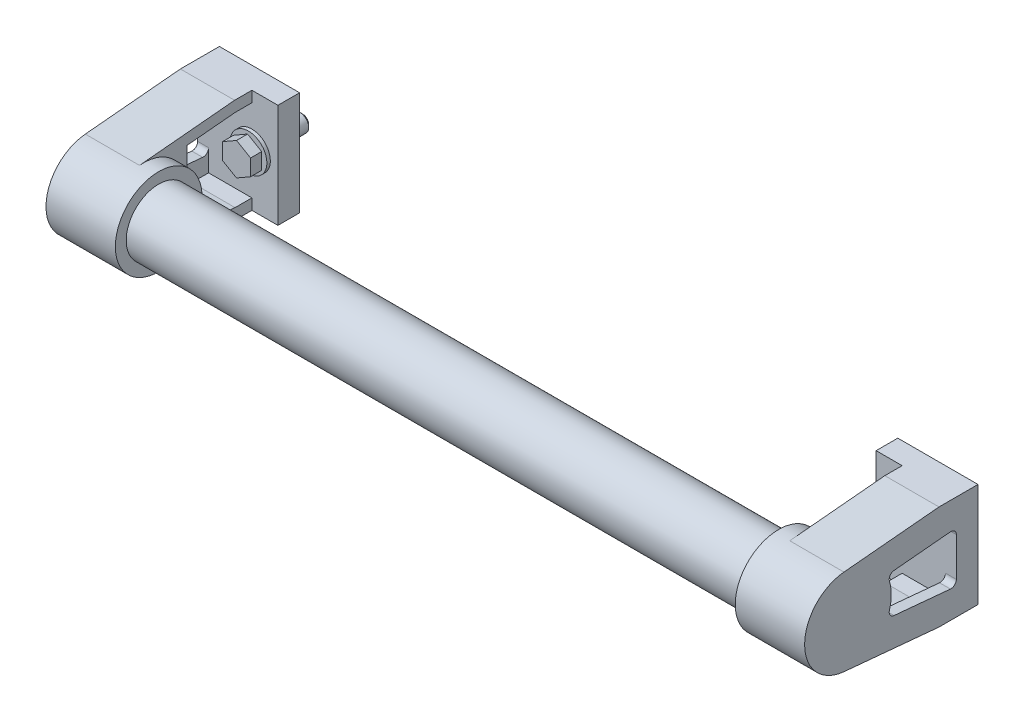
ISO-10303-21;
HEADER;
FILE_DESCRIPTION(('STEP AP214'),'2;1');
FILE_NAME('part.step','',(''),(''),'','','');
FILE_SCHEMA(('AUTOMOTIVE_DESIGN { 1 0 10303 214 1 1 1 1 }'));
ENDSEC;
DATA;
#1=APPLICATION_CONTEXT('core data for automotive mechanical design processes');
#2=APPLICATION_PROTOCOL_DEFINITION('international standard','automotive_design',2000,#1);
#3=PRODUCT_CONTEXT('',#1,'mechanical');
#4=PRODUCT('Part','Part','',(#3));
#5=PRODUCT_RELATED_PRODUCT_CATEGORY('part','',(#4));
#6=PRODUCT_DEFINITION_FORMATION('','',#4);
#7=PRODUCT_DEFINITION_CONTEXT('part definition',#1,'design');
#8=PRODUCT_DEFINITION('design','',#6,#7);
#9=PRODUCT_DEFINITION_SHAPE('','',#8);
#10=(LENGTH_UNIT() NAMED_UNIT(*) SI_UNIT(.MILLI.,.METRE.));
#11=(NAMED_UNIT(*) PLANE_ANGLE_UNIT() SI_UNIT($,.RADIAN.));
#12=(NAMED_UNIT(*) SI_UNIT($,.STERADIAN.) SOLID_ANGLE_UNIT());
#13=UNCERTAINTY_MEASURE_WITH_UNIT(LENGTH_MEASURE(1.E-05),#10,'distance_accuracy_value','');
#14=(GEOMETRIC_REPRESENTATION_CONTEXT(3) GLOBAL_UNCERTAINTY_ASSIGNED_CONTEXT((#13)) GLOBAL_UNIT_ASSIGNED_CONTEXT((#10,
#11,#12)) REPRESENTATION_CONTEXT('',''));
#15=CARTESIAN_POINT('',(0.,0.,0.));
#16=DIRECTION('',(0.,0.,1.));
#17=DIRECTION('',(1.,0.,0.));
#18=AXIS2_PLACEMENT_3D('',#15,#16,#17);
#19=CARTESIAN_POINT('',(16.,-23.9999999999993,18.0000000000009));
#20=DIRECTION('',(0.,0.995687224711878,-0.0927736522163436));
#21=DIRECTION('',(0.,0.0927736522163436,0.995687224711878));
#22=AXIS2_PLACEMENT_3D('',#19,#20,#21);
#23=PLANE('',#22);
#24=DIRECTION('',(0.,0.0927736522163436,0.995687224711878));
#25=VECTOR('',#24,1.);
#26=CARTESIAN_POINT('',(0.,-23.9999999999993,18.0000000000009));
#27=LINE('',#26,#25);
#28=CARTESIAN_POINT('',(0.,-19.9137444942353,61.8554730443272));
#29=VERTEX_POINT('',#28);
#30=CARTESIAN_POINT('',(0.,-23.9999999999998,17.999999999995));
#31=VERTEX_POINT('',#30);
#32=EDGE_CURVE('E1102',#29,#31,#27,.F.);
#33=ORIENTED_EDGE('',*,*,#32,.F.);
#34=DIRECTION('',(-1.,0.,0.));
#35=VECTOR('',#34,1.);
#36=CARTESIAN_POINT('',(7.,-19.9137444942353,61.8554730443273));
#37=LINE('',#36,#35);
#38=CARTESIAN_POINT('',(-25.,-19.9137444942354,61.8554730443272));
#39=VERTEX_POINT('',#38);
#40=EDGE_CURVE('E1038',#39,#29,#37,.F.);
#41=ORIENTED_EDGE('',*,*,#40,.F.);
#42=DIRECTION('',(0.,0.0927736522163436,0.995687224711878));
#43=VECTOR('',#42,1.);
#44=CARTESIAN_POINT('',(-25.,-23.9999999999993,18.0000000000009));
#45=LINE('',#44,#43);
#46=CARTESIAN_POINT('',(-25.,-24.,17.999999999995));
#47=VERTEX_POINT('',#46);
#48=EDGE_CURVE('E1041',#47,#39,#45,.T.);
#49=ORIENTED_EDGE('',*,*,#48,.F.);
#50=DIRECTION('',(1.,0.,0.));
#51=VECTOR('',#50,1.);
#52=CARTESIAN_POINT('',(16.,-24.,17.999999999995));
#53=LINE('',#52,#51);
#54=EDGE_CURVE('E1092',#31,#47,#53,.F.);
#55=ORIENTED_EDGE('',*,*,#54,.F.);
#56=EDGE_LOOP('',(#33,#41,#49,#55));
#57=FACE_BOUND('',#56,.T.);
#58=ADVANCED_FACE('F14',(#57),#23,.F.);
#59=CARTESIAN_POINT('',(16.,24.0000000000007,17.999999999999));
#60=DIRECTION('',(0.,0.995687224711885,0.092773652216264));
#61=DIRECTION('',(0.,-0.092773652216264,0.995687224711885));
#62=AXIS2_PLACEMENT_3D('',#59,#60,#61);
#63=PLANE('',#62);
#64=DIRECTION('',(1.,0.,0.));
#65=VECTOR('',#64,1.);
#66=CARTESIAN_POINT('',(16.,19.9137444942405,61.8554730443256));
#67=LINE('',#66,#65);
#68=CARTESIAN_POINT('',(-25.,19.9137444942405,61.8554730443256));
#69=VERTEX_POINT('',#68);
#70=CARTESIAN_POINT('',(0.,19.9137444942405,61.8554730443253));
#71=VERTEX_POINT('',#70);
#72=EDGE_CURVE('E1033',#69,#71,#67,.T.);
#73=ORIENTED_EDGE('',*,*,#72,.T.);
#74=DIRECTION('',(0.,-0.092773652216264,0.995687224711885));
#75=VECTOR('',#74,1.);
#76=CARTESIAN_POINT('',(0.,24.0000000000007,17.999999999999));
#77=LINE('',#76,#75);
#78=CARTESIAN_POINT('',(0.,24.0000000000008,17.999999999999));
#79=VERTEX_POINT('',#78);
#80=EDGE_CURVE('E1070',#71,#79,#77,.F.);
#81=ORIENTED_EDGE('',*,*,#80,.T.);
#82=DIRECTION('',(1.,0.,0.));
#83=VECTOR('',#82,1.);
#84=CARTESIAN_POINT('',(16.,24.0000000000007,17.999999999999));
#85=LINE('',#84,#83);
#86=CARTESIAN_POINT('',(-25.,24.0000000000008,17.999999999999));
#87=VERTEX_POINT('',#86);
#88=EDGE_CURVE('E1044',#79,#87,#85,.F.);
#89=ORIENTED_EDGE('',*,*,#88,.T.);
#90=DIRECTION('',(0.,-0.092773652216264,0.995687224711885));
#91=VECTOR('',#90,1.);
#92=CARTESIAN_POINT('',(-25.,24.0000000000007,17.999999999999));
#93=LINE('',#92,#91);
#94=EDGE_CURVE('E1037',#87,#69,#93,.T.);
#95=ORIENTED_EDGE('',*,*,#94,.T.);
#96=EDGE_LOOP('',(#73,#81,#89,#95));
#97=FACE_BOUND('',#96,.T.);
#98=ADVANCED_FACE('F931',(#97),#63,.T.);
#99=CARTESIAN_POINT('',(7.,2.62290189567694E-12,60.));
#100=DIRECTION('',(-1.,0.,0.));
#101=DIRECTION('',(0.,0.,1.));
#102=AXIS2_PLACEMENT_3D('',#99,#100,#101);
#103=PLANE('',#102);
#104=CARTESIAN_POINT('',(7.,2.62290189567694E-12,60.));
#105=DIRECTION('',(1.,0.,0.));
#106=DIRECTION('',(0.,0.,-1.));
#107=AXIS2_PLACEMENT_3D('',#104,#105,#106);
#108=CIRCLE('',#107,15.);
#109=CARTESIAN_POINT('',(7.,2.62290189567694E-12,45.));
#110=VERTEX_POINT('',#109);
#111=EDGE_CURVE('E9',#110,#110,#108,.T.);
#112=ORIENTED_EDGE('',*,*,#111,.F.);
#113=EDGE_LOOP('',(#112));
#114=FACE_BOUND('',#113,.T.);
#115=CARTESIAN_POINT('',(7.,2.62290189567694E-12,60.));
#116=DIRECTION('',(-1.,0.,0.));
#117=DIRECTION('',(0.,0.,1.));
#118=AXIS2_PLACEMENT_3D('',#115,#116,#117);
#119=CIRCLE('',#118,20.0000000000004);
#120=CARTESIAN_POINT('',(7.,2.62290189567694E-12,80.0000000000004));
#121=VERTEX_POINT('',#120);
#122=EDGE_CURVE('E1036',#121,#121,#119,.T.);
#123=ORIENTED_EDGE('',*,*,#122,.F.);
#124=EDGE_LOOP('',(#123));
#125=FACE_BOUND('',#124,.T.);
#126=ADVANCED_FACE('F819',(#114,#125),#103,.F.);
#127=CARTESIAN_POINT('',(-6.5,4.9960036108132E-13,12.));
#128=DIRECTION('',(0.,0.,-1.));
#129=DIRECTION('',(0.,1.,0.));
#130=AXIS2_PLACEMENT_3D('',#127,#128,#129);
#131=PLANE('',#130);
#132=CARTESIAN_POINT('',(0.,4.99600361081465E-13,12.));
#133=DIRECTION('',(0.,0.,1.));
#134=DIRECTION('',(0.,-1.,0.));
#135=AXIS2_PLACEMENT_3D('',#132,#133,#134);
#136=CIRCLE('',#135,5.85000000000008);
#137=CARTESIAN_POINT('',(0.,-5.84999999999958,12.0000000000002));
#138=VERTEX_POINT('',#137);
#139=EDGE_CURVE('E992',#138,#138,#136,.F.);
#140=ORIENTED_EDGE('',*,*,#139,.F.);
#141=EDGE_LOOP('',(#140));
#142=FACE_BOUND('',#141,.T.);
#143=DIRECTION('',(0.866025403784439,0.5,0.));
#144=VECTOR('',#143,1.);
#145=CARTESIAN_POINT('',(0.,-7.50555349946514,12.));
#146=LINE('',#145,#144);
#147=CARTESIAN_POINT('',(0.,-7.50555349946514,12.));
#148=VERTEX_POINT('',#147);
#149=CARTESIAN_POINT('',(6.5,-3.75277674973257,12.));
#150=VERTEX_POINT('',#149);
#151=EDGE_CURVE('E985',#148,#150,#146,.T.);
#152=ORIENTED_EDGE('',*,*,#151,.F.);
#153=DIRECTION('',(0.866025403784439,-0.5,0.));
#154=VECTOR('',#153,1.);
#155=CARTESIAN_POINT('',(-6.5,-3.75277674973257,12.));
#156=LINE('',#155,#154);
#157=CARTESIAN_POINT('',(-6.5,-3.75277674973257,12.));
#158=VERTEX_POINT('',#157);
#159=EDGE_CURVE('E1007',#158,#148,#156,.T.);
#160=ORIENTED_EDGE('',*,*,#159,.F.);
#161=DIRECTION('',(0.,-1.,0.));
#162=VECTOR('',#161,1.);
#163=CARTESIAN_POINT('',(-6.5,3.75277674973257,12.));
#164=LINE('',#163,#162);
#165=CARTESIAN_POINT('',(-6.5,3.75277674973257,12.));
#166=VERTEX_POINT('',#165);
#167=EDGE_CURVE('E1000',#166,#158,#164,.T.);
#168=ORIENTED_EDGE('',*,*,#167,.F.);
#169=DIRECTION('',(-0.866025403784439,-0.5,0.));
#170=VECTOR('',#169,1.);
#171=CARTESIAN_POINT('',(0.,7.50555349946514,12.));
#172=LINE('',#171,#170);
#173=CARTESIAN_POINT('',(0.,7.50555349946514,12.));
#174=VERTEX_POINT('',#173);
#175=EDGE_CURVE('E997',#174,#166,#172,.T.);
#176=ORIENTED_EDGE('',*,*,#175,.F.);
#177=DIRECTION('',(-0.866025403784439,0.5,0.));
#178=VECTOR('',#177,1.);
#179=CARTESIAN_POINT('',(6.5,3.75277674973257,12.));
#180=LINE('',#179,#178);
#181=CARTESIAN_POINT('',(6.5,3.75277674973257,12.));
#182=VERTEX_POINT('',#181);
#183=EDGE_CURVE('E990',#182,#174,#180,.T.);
#184=ORIENTED_EDGE('',*,*,#183,.F.);
#185=DIRECTION('',(0.,1.,0.));
#186=VECTOR('',#185,1.);
#187=CARTESIAN_POINT('',(6.5,-3.75277674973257,12.));
#188=LINE('',#187,#186);
#189=EDGE_CURVE('E971',#150,#182,#188,.T.);
#190=ORIENTED_EDGE('',*,*,#189,.F.);
#191=EDGE_LOOP('',(#152,#160,#168,#176,#184,#190));
#192=FACE_BOUND('',#191,.T.);
#193=ADVANCED_FACE('F815',(#142,#192),#131,.T.);
#194=CARTESIAN_POINT('',(0.,3.33066907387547E-12,80.));
#195=DIRECTION('',(0.,0.,1.));
#196=DIRECTION('',(0.,-1.,0.));
#197=AXIS2_PLACEMENT_3D('',#194,#195,#196);
#198=CYLINDRICAL_SURFACE('',#197,5.85000000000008);
#199=ORIENTED_EDGE('',*,*,#139,.T.);
#200=EDGE_LOOP('',(#199));
#201=FACE_BOUND('',#200,.T.);
#202=CARTESIAN_POINT('',(0.,4.82947015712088E-13,11.6));
#203=DIRECTION('',(0.,0.,1.));
#204=DIRECTION('',(0.,-1.,0.));
#205=AXIS2_PLACEMENT_3D('',#202,#203,#204);
#206=CIRCLE('',#205,5.85000000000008);
#207=CARTESIAN_POINT('',(0.,-5.8499999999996,11.6000000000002));
#208=VERTEX_POINT('',#207);
#209=EDGE_CURVE('E1331',#208,#208,#206,.F.);
#210=ORIENTED_EDGE('',*,*,#209,.F.);
#211=EDGE_LOOP('',(#210));
#212=FACE_BOUND('',#211,.T.);
#213=ADVANCED_FACE('F818',(#201,#212),#198,.T.);
#214=CARTESIAN_POINT('',(-5.85,4.71844785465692E-13,11.6));
#215=DIRECTION('',(0.,0.,1.));
#216=DIRECTION('',(0.,-1.,0.));
#217=AXIS2_PLACEMENT_3D('',#214,#215,#216);
#218=PLANE('',#217);
#219=CARTESIAN_POINT('',(0.,4.82947015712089E-13,11.6));
#220=DIRECTION('',(0.,0.,1.));
#221=DIRECTION('',(0.,-1.,0.));
#222=AXIS2_PLACEMENT_3D('',#219,#220,#221);
#223=CIRCLE('',#222,8.50000000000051);
#224=CARTESIAN_POINT('',(0.,-8.50000000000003,11.6000000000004));
#225=VERTEX_POINT('',#224);
#226=EDGE_CURVE('E1278',#225,#225,#223,.F.);
#227=ORIENTED_EDGE('',*,*,#226,.F.);
#228=EDGE_LOOP('',(#227));
#229=FACE_BOUND('',#228,.T.);
#230=ORIENTED_EDGE('',*,*,#209,.T.);
#231=EDGE_LOOP('',(#230));
#232=FACE_BOUND('',#231,.T.);
#233=ADVANCED_FACE('F827',(#229,#232),#218,.T.);
#234=CARTESIAN_POINT('',(0.,5.27355936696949E-13,12.7319341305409));
#235=DIRECTION('',(0.,0.,1.));
#236=DIRECTION('',(0.,-1.,0.));
#237=AXIS2_PLACEMENT_3D('',#234,#235,#236);
#238=CYLINDRICAL_SURFACE('',#237,3.99999999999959);
#239=CARTESIAN_POINT('',(0.,-5.10644337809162E-13,-12.2));
#240=DIRECTION('',(0.,0.,1.));
#241=DIRECTION('',(0.,-1.,0.));
#242=AXIS2_PLACEMENT_3D('',#239,#240,#241);
#243=CIRCLE('',#242,3.99999999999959);
#244=CARTESIAN_POINT('',(0.,-4.0000000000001,-12.1999999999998));
#245=VERTEX_POINT('',#244);
#246=EDGE_CURVE('E1302',#245,#245,#243,.T.);
#247=ORIENTED_EDGE('',*,*,#246,.T.);
#248=EDGE_LOOP('',(#247));
#249=FACE_BOUND('',#248,.T.);
#250=CARTESIAN_POINT('',(0.,0.,0.));
#251=DIRECTION('',(0.,0.,1.));
#252=DIRECTION('',(0.,-1.,0.));
#253=AXIS2_PLACEMENT_3D('',#250,#251,#252);
#254=CIRCLE('',#253,3.99999999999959);
#255=CARTESIAN_POINT('',(0.,-3.99999999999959,1.1102230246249E-13));
#256=VERTEX_POINT('',#255);
#257=EDGE_CURVE('E1173',#256,#256,#254,.T.);
#258=ORIENTED_EDGE('',*,*,#257,.F.);
#259=EDGE_LOOP('',(#258));
#260=FACE_BOUND('',#259,.T.);
#261=ADVANCED_FACE('F831',(#249,#260),#238,.T.);
#262=CARTESIAN_POINT('',(0.,3.33066907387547E-12,80.));
#263=DIRECTION('',(0.,0.,1.));
#264=DIRECTION('',(0.,-1.,0.));
#265=AXIS2_PLACEMENT_3D('',#262,#263,#264);
#266=CYLINDRICAL_SURFACE('',#265,8.50000000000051);
#267=ORIENTED_EDGE('',*,*,#226,.T.);
#268=EDGE_LOOP('',(#267));
#269=FACE_BOUND('',#268,.T.);
#270=CARTESIAN_POINT('',(0.,4.16333634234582E-13,10.));
#271=DIRECTION('',(0.,0.,1.));
#272=DIRECTION('',(0.,-1.,0.));
#273=AXIS2_PLACEMENT_3D('',#270,#271,#272);
#274=CIRCLE('',#273,8.50000000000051);
#275=CARTESIAN_POINT('',(0.,-8.50000000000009,10.0000000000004));
#276=VERTEX_POINT('',#275);
#277=EDGE_CURVE('E1139',#276,#276,#274,.T.);
#278=ORIENTED_EDGE('',*,*,#277,.T.);
#279=EDGE_LOOP('',(#278));
#280=FACE_BOUND('',#279,.T.);
#281=ADVANCED_FACE('F835',(#269,#280),#266,.T.);
#282=CARTESIAN_POINT('',(-20.,-18.9999999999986,40.0000000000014));
#283=DIRECTION('',(1.,0.,0.));
#284=DIRECTION('',(0.,0.,-1.));
#285=AXIS2_PLACEMENT_3D('',#282,#283,#284);
#286=PLANE('',#285);
#287=DIRECTION('',(0.,1.,0.));
#288=VECTOR('',#287,1.);
#289=CARTESIAN_POINT('',(-20.,-23.9999999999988,40.0000000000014));
#290=LINE('',#289,#288);
#291=CARTESIAN_POINT('',(-20.,-16.9284817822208,40.0000000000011));
#292=VERTEX_POINT('',#291);
#293=CARTESIAN_POINT('',(-20.,-8.50076165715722,40.0000000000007));
#294=VERTEX_POINT('',#293);
#295=EDGE_CURVE('E1243',#292,#294,#290,.T.);
#296=ORIENTED_EDGE('',*,*,#295,.F.);
#297=DIRECTION('',(0.,-0.0927736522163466,-0.995687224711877));
#298=VECTOR('',#297,1.);
#299=CARTESIAN_POINT('',(-20.,-18.9999999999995,17.7675646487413));
#300=LINE('',#299,#298);
#301=CARTESIAN_POINT('',(-20.,-18.9999999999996,17.7675646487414));
#302=VERTEX_POINT('',#301);
#303=EDGE_CURVE('E1253',#292,#302,#300,.T.);
#304=ORIENTED_EDGE('',*,*,#303,.T.);
#305=DIRECTION('',(0.,0.,-1.));
#306=VECTOR('',#305,1.);
#307=CARTESIAN_POINT('',(-20.,-19.,10.0000000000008));
#308=LINE('',#307,#306);
#309=CARTESIAN_POINT('',(-20.,-19.,10.0000000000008));
#310=VERTEX_POINT('',#309);
#311=EDGE_CURVE('E1275',#302,#310,#308,.T.);
#312=ORIENTED_EDGE('',*,*,#311,.T.);
#313=DIRECTION('',(0.,1.,0.));
#314=VECTOR('',#313,1.);
#315=CARTESIAN_POINT('',(-20.,-8.94532766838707,10.0000000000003));
#316=LINE('',#315,#314);
#317=CARTESIAN_POINT('',(-20.,-8.94532766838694,10.0000000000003));
#318=VERTEX_POINT('',#317);
#319=EDGE_CURVE('E1133',#310,#318,#316,.T.);
#320=ORIENTED_EDGE('',*,*,#319,.T.);
#321=CARTESIAN_POINT('',(-20.,-8.94532766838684,12.5000000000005));
#322=DIRECTION('',(-1.,0.,0.));
#323=DIRECTION('',(0.,0.,1.));
#324=AXIS2_PLACEMENT_3D('',#321,#322,#323);
#325=CIRCLE('',#324,2.5);
#326=CARTESIAN_POINT('',(-20.,-11.4345457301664,12.7319341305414));
#327=VERTEX_POINT('',#326);
#328=EDGE_CURVE('E1140',#318,#327,#325,.T.);
#329=ORIENTED_EDGE('',*,*,#328,.T.);
#330=DIRECTION('',(0.,0.0927736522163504,0.995687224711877));
#331=VECTOR('',#330,1.);
#332=CARTESIAN_POINT('',(-20.,-11.4345457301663,12.7319341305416));
#333=LINE('',#332,#331);
#334=CARTESIAN_POINT('',(-20.,-9.01504355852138,38.6990847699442));
#335=VERTEX_POINT('',#334);
#336=EDGE_CURVE('E1144',#335,#327,#333,.F.);
#337=ORIENTED_EDGE('',*,*,#336,.F.);
#338=CARTESIAN_POINT('',(-20.,-6.52582549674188,38.4671506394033));
#339=DIRECTION('',(-1.,0.,0.));
#340=DIRECTION('',(0.,0.,1.));
#341=AXIS2_PLACEMENT_3D('',#338,#339,#340);
#342=CIRCLE('',#341,2.5);
#343=EDGE_CURVE('E1149',#335,#294,#342,.T.);
#344=ORIENTED_EDGE('',*,*,#343,.T.);
#345=EDGE_LOOP('',(#296,#304,#312,#320,#329,#337,#344));
#346=FACE_BOUND('',#345,.T.);
#347=ADVANCED_FACE('F839',(#346),#286,.T.);
#348=CARTESIAN_POINT('',(-20.,-18.9999999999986,40.0000000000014));
#349=DIRECTION('',(1.,0.,0.));
#350=DIRECTION('',(0.,0.,-1.));
#351=AXIS2_PLACEMENT_3D('',#348,#349,#350);
#352=PLANE('',#351);
#353=DIRECTION('',(0.,1.,0.));
#354=VECTOR('',#353,1.);
#355=CARTESIAN_POINT('',(-20.,-8.94532766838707,10.0000000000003));
#356=LINE('',#355,#354);
#357=CARTESIAN_POINT('',(-20.,8.94532766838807,9.99999999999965));
#358=VERTEX_POINT('',#357);
#359=CARTESIAN_POINT('',(-20.,19.0000000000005,9.99999999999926));
#360=VERTEX_POINT('',#359);
#361=EDGE_CURVE('E1136',#358,#360,#356,.T.);
#362=ORIENTED_EDGE('',*,*,#361,.T.);
#363=DIRECTION('',(0.,0.,-1.));
#364=VECTOR('',#363,1.);
#365=CARTESIAN_POINT('',(-20.,19.0000000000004,9.99999999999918));
#366=LINE('',#365,#364);
#367=CARTESIAN_POINT('',(-20.,19.0000000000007,17.7675646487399));
#368=VERTEX_POINT('',#367);
#369=EDGE_CURVE('E1211',#368,#360,#366,.T.);
#370=ORIENTED_EDGE('',*,*,#369,.F.);
#371=DIRECTION('',(0.,0.0927736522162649,-0.995687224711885));
#372=VECTOR('',#371,1.);
#373=CARTESIAN_POINT('',(-20.,19.0000000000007,17.7675646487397));
#374=LINE('',#373,#372);
#375=CARTESIAN_POINT('',(-20.,16.9284817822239,40.));
#376=VERTEX_POINT('',#375);
#377=EDGE_CURVE('E1212',#376,#368,#374,.T.);
#378=ORIENTED_EDGE('',*,*,#377,.F.);
#379=DIRECTION('',(0.,1.,0.));
#380=VECTOR('',#379,1.);
#381=CARTESIAN_POINT('',(-20.,-23.9999999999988,40.0000000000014));
#382=LINE('',#381,#380);
#383=CARTESIAN_POINT('',(-20.,8.50076165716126,40.));
#384=VERTEX_POINT('',#383);
#385=EDGE_CURVE('E1222',#384,#376,#382,.T.);
#386=ORIENTED_EDGE('',*,*,#385,.F.);
#387=CARTESIAN_POINT('',(-20.,6.52582549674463,38.4671506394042));
#388=DIRECTION('',(-1.,0.,0.));
#389=DIRECTION('',(0.,0.,1.));
#390=AXIS2_PLACEMENT_3D('',#387,#388,#389);
#391=CIRCLE('',#390,2.5);
#392=CARTESIAN_POINT('',(-20.,9.01504355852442,38.699084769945));
#393=VERTEX_POINT('',#392);
#394=EDGE_CURVE('E1150',#384,#393,#391,.T.);
#395=ORIENTED_EDGE('',*,*,#394,.T.);
#396=DIRECTION('',(0.,-0.0927736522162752,0.995687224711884));
#397=VECTOR('',#396,1.);
#398=CARTESIAN_POINT('',(-20.,11.4345457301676,12.7319341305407));
#399=LINE('',#398,#397);
#400=CARTESIAN_POINT('',(-20.,11.4345457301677,12.7319341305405));
#401=VERTEX_POINT('',#400);
#402=EDGE_CURVE('E1154',#393,#401,#399,.F.);
#403=ORIENTED_EDGE('',*,*,#402,.T.);
#404=CARTESIAN_POINT('',(-20.,8.94532766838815,12.4999999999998));
#405=DIRECTION('',(-1.,0.,0.));
#406=DIRECTION('',(0.,0.,1.));
#407=AXIS2_PLACEMENT_3D('',#404,#405,#406);
#408=CIRCLE('',#407,2.5);
#409=EDGE_CURVE('E1172',#401,#358,#408,.T.);
#410=ORIENTED_EDGE('',*,*,#409,.T.);
#411=EDGE_LOOP('',(#362,#370,#378,#386,#395,#403,#410));
#412=FACE_BOUND('',#411,.T.);
#413=ADVANCED_FACE('F843',(#412),#352,.T.);
#414=CARTESIAN_POINT('',(-11.,-19.,10.0000000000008));
#415=DIRECTION('',(0.,-1.,0.));
#416=DIRECTION('',(0.,0.,-1.));
#417=AXIS2_PLACEMENT_3D('',#414,#415,#416);
#418=PLANE('',#417);
#419=ORIENTED_EDGE('',*,*,#311,.F.);
#420=DIRECTION('',(1.,0.,0.));
#421=VECTOR('',#420,1.);
#422=CARTESIAN_POINT('',(-11.,-18.9999999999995,17.7675646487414));
#423=LINE('',#422,#421);
#424=CARTESIAN_POINT('',(0.,-19.,17.7675646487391));
#425=VERTEX_POINT('',#424);
#426=EDGE_CURVE('E1244',#302,#425,#423,.T.);
#427=ORIENTED_EDGE('',*,*,#426,.T.);
#428=DIRECTION('',(0.,0.,-1.));
#429=VECTOR('',#428,1.);
#430=CARTESIAN_POINT('',(0.,-19.,38.4671506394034));
#431=LINE('',#430,#429);
#432=CARTESIAN_POINT('',(0.,-19.,10.0000000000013));
#433=VERTEX_POINT('',#432);
#434=EDGE_CURVE('E1227',#433,#425,#431,.F.);
#435=ORIENTED_EDGE('',*,*,#434,.F.);
#436=DIRECTION('',(1.,0.,0.));
#437=VECTOR('',#436,1.);
#438=CARTESIAN_POINT('',(16.,-19.,10.0000000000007));
#439=LINE('',#438,#437);
#440=EDGE_CURVE('E1187',#433,#310,#439,.F.);
#441=ORIENTED_EDGE('',*,*,#440,.T.);
#442=EDGE_LOOP('',(#419,#427,#435,#441));
#443=FACE_BOUND('',#442,.T.);
#444=ADVANCED_FACE('F847',(#443),#418,.F.);
#445=CARTESIAN_POINT('',(-11.,-18.9999999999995,17.7675646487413));
#446=DIRECTION('',(0.,-0.995687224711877,0.0927736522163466));
#447=DIRECTION('',(0.,-0.0927736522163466,-0.995687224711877));
#448=AXIS2_PLACEMENT_3D('',#445,#446,#447);
#449=PLANE('',#448);
#450=ORIENTED_EDGE('',*,*,#303,.F.);
#451=DIRECTION('',(1.,0.,0.));
#452=VECTOR('',#451,1.);
#453=CARTESIAN_POINT('',(3.99999999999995,-16.9284817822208,40.0000000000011));
#454=LINE('',#453,#452);
#455=CARTESIAN_POINT('',(0.,-16.9284817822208,40.0000000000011));
#456=VERTEX_POINT('',#455);
#457=EDGE_CURVE('E1240',#456,#292,#454,.F.);
#458=ORIENTED_EDGE('',*,*,#457,.F.);
#459=DIRECTION('',(0.,0.0927736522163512,0.995687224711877));
#460=VECTOR('',#459,1.);
#461=CARTESIAN_POINT('',(0.,-18.9999999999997,17.7675646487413));
#462=LINE('',#461,#460);
#463=EDGE_CURVE('E1120',#425,#456,#462,.T.);
#464=ORIENTED_EDGE('',*,*,#463,.F.);
#465=ORIENTED_EDGE('',*,*,#426,.F.);
#466=EDGE_LOOP('',(#450,#458,#464,#465));
#467=FACE_BOUND('',#466,.T.);
#468=ADVANCED_FACE('F851',(#467),#449,.F.);
#469=CARTESIAN_POINT('',(3.99999999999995,-23.9999999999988,40.0000000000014));
#470=DIRECTION('',(0.,0.,-1.));
#471=DIRECTION('',(0.,1.,0.));
#472=AXIS2_PLACEMENT_3D('',#469,#470,#471);
#473=PLANE('',#472);
#474=ORIENTED_EDGE('',*,*,#457,.T.);
#475=ORIENTED_EDGE('',*,*,#295,.T.);
#476=DIRECTION('',(-1.,0.,0.));
#477=VECTOR('',#476,1.);
#478=CARTESIAN_POINT('',(16.,-8.50076165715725,40.0000000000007));
#479=LINE('',#478,#477);
#480=CARTESIAN_POINT('',(0.,-8.50076165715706,40.0000000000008));
#481=VERTEX_POINT('',#480);
#482=EDGE_CURVE('E1145',#294,#481,#479,.F.);
#483=ORIENTED_EDGE('',*,*,#482,.T.);
#484=DIRECTION('',(0.,1.,0.));
#485=VECTOR('',#484,1.);
#486=CARTESIAN_POINT('',(0.,-6.52582549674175,40.0000000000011));
#487=LINE('',#486,#485);
#488=EDGE_CURVE('E1116',#456,#481,#487,.T.);
#489=ORIENTED_EDGE('',*,*,#488,.F.);
#490=EDGE_LOOP('',(#474,#475,#483,#489));
#491=FACE_BOUND('',#490,.T.);
#492=ADVANCED_FACE('F855',(#491),#473,.T.);
#493=CARTESIAN_POINT('',(3.99999999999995,-23.9999999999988,40.0000000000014));
#494=DIRECTION('',(0.,0.,-1.));
#495=DIRECTION('',(0.,1.,0.));
#496=AXIS2_PLACEMENT_3D('',#493,#494,#495);
#497=PLANE('',#496);
#498=DIRECTION('',(-1.,0.,0.));
#499=VECTOR('',#498,1.);
#500=CARTESIAN_POINT('',(16.,8.50076165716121,40.));
#501=LINE('',#500,#499);
#502=CARTESIAN_POINT('',(0.,8.50076165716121,40.));
#503=VERTEX_POINT('',#502);
#504=EDGE_CURVE('E1153',#503,#384,#501,.T.);
#505=ORIENTED_EDGE('',*,*,#504,.T.);
#506=ORIENTED_EDGE('',*,*,#385,.T.);
#507=DIRECTION('',(1.,0.,0.));
#508=VECTOR('',#507,1.);
#509=CARTESIAN_POINT('',(-11.,16.9284817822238,40.));
#510=LINE('',#509,#508);
#511=CARTESIAN_POINT('',(0.,16.9284817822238,40.));
#512=VERTEX_POINT('',#511);
#513=EDGE_CURVE('E1219',#512,#376,#510,.F.);
#514=ORIENTED_EDGE('',*,*,#513,.F.);
#515=DIRECTION('',(0.,1.,0.));
#516=VECTOR('',#515,1.);
#517=CARTESIAN_POINT('',(0.,2.62290189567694E-12,40.));
#518=LINE('',#517,#516);
#519=EDGE_CURVE('E1084',#503,#512,#518,.T.);
#520=ORIENTED_EDGE('',*,*,#519,.F.);
#521=EDGE_LOOP('',(#505,#506,#514,#520));
#522=FACE_BOUND('',#521,.T.);
#523=ADVANCED_FACE('F859',(#522),#497,.T.);
#524=CARTESIAN_POINT('',(-11.,19.0000000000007,17.7675646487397));
#525=DIRECTION('',(0.,-0.995687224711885,-0.0927736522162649));
#526=DIRECTION('',(0.,0.0927736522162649,-0.995687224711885));
#527=AXIS2_PLACEMENT_3D('',#524,#525,#526);
#528=PLANE('',#527);
#529=DIRECTION('',(1.,0.,0.));
#530=VECTOR('',#529,1.);
#531=CARTESIAN_POINT('',(-11.,19.0000000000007,17.7675646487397));
#532=LINE('',#531,#530);
#533=CARTESIAN_POINT('',(0.,19.0000000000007,17.7675646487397));
#534=VERTEX_POINT('',#533);
#535=EDGE_CURVE('E1208',#534,#368,#532,.F.);
#536=ORIENTED_EDGE('',*,*,#535,.F.);
#537=DIRECTION('',(0.,0.0927736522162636,-0.995687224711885));
#538=VECTOR('',#537,1.);
#539=CARTESIAN_POINT('',(0.,16.9284817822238,40.));
#540=LINE('',#539,#538);
#541=EDGE_CURVE('E1087',#512,#534,#540,.T.);
#542=ORIENTED_EDGE('',*,*,#541,.F.);
#543=ORIENTED_EDGE('',*,*,#513,.T.);
#544=ORIENTED_EDGE('',*,*,#377,.T.);
#545=EDGE_LOOP('',(#536,#542,#543,#544));
#546=FACE_BOUND('',#545,.T.);
#547=ADVANCED_FACE('F863',(#546),#528,.T.);
#548=CARTESIAN_POINT('',(-11.,19.0000000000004,9.99999999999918));
#549=DIRECTION('',(0.,-1.,0.));
#550=DIRECTION('',(0.,0.,-1.));
#551=AXIS2_PLACEMENT_3D('',#548,#549,#550);
#552=PLANE('',#551);
#553=DIRECTION('',(1.,0.,0.));
#554=VECTOR('',#553,1.);
#555=CARTESIAN_POINT('',(16.,19.0000000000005,9.99999999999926));
#556=LINE('',#555,#554);
#557=CARTESIAN_POINT('',(0.,19.0000000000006,9.99999999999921));
#558=VERTEX_POINT('',#557);
#559=EDGE_CURVE('E1198',#360,#558,#556,.T.);
#560=ORIENTED_EDGE('',*,*,#559,.T.);
#561=DIRECTION('',(0.,0.,-1.));
#562=VECTOR('',#561,1.);
#563=CARTESIAN_POINT('',(0.,19.0000000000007,60.));
#564=LINE('',#563,#562);
#565=EDGE_CURVE('E1193',#534,#558,#564,.T.);
#566=ORIENTED_EDGE('',*,*,#565,.F.);
#567=ORIENTED_EDGE('',*,*,#535,.T.);
#568=ORIENTED_EDGE('',*,*,#369,.T.);
#569=EDGE_LOOP('',(#560,#566,#567,#568));
#570=FACE_BOUND('',#569,.T.);
#571=ADVANCED_FACE('F867',(#570),#552,.T.);
#572=CARTESIAN_POINT('',(12.,-24.,10.0000000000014));
#573=DIRECTION('',(1.,0.,0.));
#574=DIRECTION('',(0.,0.,-1.));
#575=AXIS2_PLACEMENT_3D('',#572,#573,#574);
#576=PLANE('',#575);
#577=DIRECTION('',(0.,1.,0.));
#578=VECTOR('',#577,1.);
#579=CARTESIAN_POINT('',(12.,-24.0000000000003,9.43689570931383E-13));
#580=LINE('',#579,#578);
#581=CARTESIAN_POINT('',(12.,24.,-1.0177044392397E-12));
#582=VERTEX_POINT('',#581);
#583=CARTESIAN_POINT('',(12.,-24.0000000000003,9.43689570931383E-13));
#584=VERTEX_POINT('',#583);
#585=EDGE_CURVE('E1169',#582,#584,#580,.F.);
#586=ORIENTED_EDGE('',*,*,#585,.F.);
#587=DIRECTION('',(0.,0.,1.));
#588=VECTOR('',#587,1.);
#589=CARTESIAN_POINT('',(12.,24.,-1.0547118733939E-12));
#590=LINE('',#589,#588);
#591=CARTESIAN_POINT('',(12.,24.0000000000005,9.99999999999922));
#592=VERTEX_POINT('',#591);
#593=EDGE_CURVE('E1157',#592,#582,#590,.F.);
#594=ORIENTED_EDGE('',*,*,#593,.F.);
#595=DIRECTION('',(0.,1.,0.));
#596=VECTOR('',#595,1.);
#597=CARTESIAN_POINT('',(12.,-8.94532766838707,10.0000000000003));
#598=LINE('',#597,#596);
#599=CARTESIAN_POINT('',(12.,-24.,10.0000000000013));
#600=VERTEX_POINT('',#599);
#601=EDGE_CURVE('E1184',#592,#600,#598,.F.);
#602=ORIENTED_EDGE('',*,*,#601,.T.);
#603=DIRECTION('',(0.,0.,1.));
#604=VECTOR('',#603,1.);
#605=CARTESIAN_POINT('',(12.,-24.0000000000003,9.43689570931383E-13));
#606=LINE('',#605,#604);
#607=EDGE_CURVE('E1166',#600,#584,#606,.F.);
#608=ORIENTED_EDGE('',*,*,#607,.T.);
#609=EDGE_LOOP('',(#586,#594,#602,#608));
#610=FACE_BOUND('',#609,.T.);
#611=ADVANCED_FACE('F871',(#610),#576,.T.);
#612=CARTESIAN_POINT('',(16.,-24.0000000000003,9.43689570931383E-13));
#613=DIRECTION('',(0.,0.,-1.));
#614=DIRECTION('',(0.,1.,0.));
#615=AXIS2_PLACEMENT_3D('',#612,#613,#614);
#616=PLANE('',#615);
#617=DIRECTION('',(1.,0.,0.));
#618=VECTOR('',#617,1.);
#619=CARTESIAN_POINT('',(16.,-24.0000000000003,9.43689570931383E-13));
#620=LINE('',#619,#618);
#621=CARTESIAN_POINT('',(-25.,-24.0000000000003,-3.88578058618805E-13));
#622=VERTEX_POINT('',#621);
#623=EDGE_CURVE('E1108',#584,#622,#620,.F.);
#624=ORIENTED_EDGE('',*,*,#623,.T.);
#625=DIRECTION('',(0.,1.,0.));
#626=VECTOR('',#625,1.);
#627=CARTESIAN_POINT('',(-25.,2.62290189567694E-12,-1.0547118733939E-12));
#628=LINE('',#627,#626);
#629=CARTESIAN_POINT('',(-25.,24.0000000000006,-1.0547118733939E-12));
#630=VERTEX_POINT('',#629);
#631=EDGE_CURVE('E1064',#630,#622,#628,.F.);
#632=ORIENTED_EDGE('',*,*,#631,.F.);
#633=DIRECTION('',(1.,0.,0.));
#634=VECTOR('',#633,1.);
#635=CARTESIAN_POINT('',(16.,24.,-1.0547118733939E-12));
#636=LINE('',#635,#634);
#637=EDGE_CURVE('E1097',#582,#630,#636,.F.);
#638=ORIENTED_EDGE('',*,*,#637,.F.);
#639=ORIENTED_EDGE('',*,*,#585,.T.);
#640=EDGE_LOOP('',(#624,#632,#638,#639));
#641=FACE_BOUND('',#640,.T.);
#642=ORIENTED_EDGE('',*,*,#257,.T.);
#643=EDGE_LOOP('',(#642));
#644=FACE_BOUND('',#643,.T.);
#645=ADVANCED_FACE('F875',(#641,#644),#616,.T.);
#646=CARTESIAN_POINT('',(7.,8.94532766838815,12.4999999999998));
#647=DIRECTION('',(-1.,0.,0.));
#648=DIRECTION('',(0.,0.,1.));
#649=AXIS2_PLACEMENT_3D('',#646,#647,#648);
#650=CYLINDRICAL_SURFACE('',#649,2.5);
#651=DIRECTION('',(1.,0.,0.));
#652=VECTOR('',#651,1.);
#653=CARTESIAN_POINT('',(7.,11.4345457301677,12.7319341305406));
#654=LINE('',#653,#652);
#655=CARTESIAN_POINT('',(-25.,11.4345457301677,12.7319341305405));
#656=VERTEX_POINT('',#655);
#657=EDGE_CURVE('E1151',#401,#656,#654,.F.);
#658=ORIENTED_EDGE('',*,*,#657,.T.);
#659=CARTESIAN_POINT('',(-25.,8.94532766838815,12.4999999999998));
#660=DIRECTION('',(-1.,0.,0.));
#661=DIRECTION('',(0.,0.,1.));
#662=AXIS2_PLACEMENT_3D('',#659,#660,#661);
#663=CIRCLE('',#662,2.5);
#664=CARTESIAN_POINT('',(-25.,8.94532766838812,10.));
#665=VERTEX_POINT('',#664);
#666=EDGE_CURVE('E1060',#665,#656,#663,.F.);
#667=ORIENTED_EDGE('',*,*,#666,.F.);
#668=DIRECTION('',(1.,0.,0.));
#669=VECTOR('',#668,1.);
#670=CARTESIAN_POINT('',(16.,8.94532766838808,9.99999999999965));
#671=LINE('',#670,#669);
#672=EDGE_CURVE('E1132',#665,#358,#671,.T.);
#673=ORIENTED_EDGE('',*,*,#672,.T.);
#674=ORIENTED_EDGE('',*,*,#409,.F.);
#675=EDGE_LOOP('',(#658,#667,#673,#674));
#676=FACE_BOUND('',#675,.T.);
#677=ADVANCED_FACE('F879',(#676),#650,.F.);
#678=CARTESIAN_POINT('',(7.,11.4345457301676,12.7319341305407));
#679=DIRECTION('',(0.,0.995687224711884,0.0927736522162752));
#680=DIRECTION('',(0.,-0.0927736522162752,0.995687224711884));
#681=AXIS2_PLACEMENT_3D('',#678,#679,#680);
#682=PLANE('',#681);
#683=DIRECTION('',(0.,-0.0927736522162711,0.995687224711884));
#684=VECTOR('',#683,1.);
#685=CARTESIAN_POINT('',(-25.,11.4345457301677,12.7319341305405));
#686=LINE('',#685,#684);
#687=CARTESIAN_POINT('',(-25.,9.01504355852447,38.699084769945));
#688=VERTEX_POINT('',#687);
#689=EDGE_CURVE('E1056',#656,#688,#686,.T.);
#690=ORIENTED_EDGE('',*,*,#689,.F.);
#691=ORIENTED_EDGE('',*,*,#657,.F.);
#692=ORIENTED_EDGE('',*,*,#402,.F.);
#693=DIRECTION('',(-1.,0.,0.));
#694=VECTOR('',#693,1.);
#695=CARTESIAN_POINT('',(16.,9.01504355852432,38.6990847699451));
#696=LINE('',#695,#694);
#697=EDGE_CURVE('E1146',#393,#688,#696,.T.);
#698=ORIENTED_EDGE('',*,*,#697,.T.);
#699=EDGE_LOOP('',(#690,#691,#692,#698));
#700=FACE_BOUND('',#699,.T.);
#701=ADVANCED_FACE('F883',(#700),#682,.F.);
#702=CARTESIAN_POINT('',(7.,-11.4345457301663,12.7319341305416));
#703=DIRECTION('',(0.,0.995687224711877,-0.0927736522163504));
#704=DIRECTION('',(0.,0.0927736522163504,0.995687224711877));
#705=AXIS2_PLACEMENT_3D('',#702,#703,#704);
#706=PLANE('',#705);
#707=DIRECTION('',(-1.,0.,0.));
#708=VECTOR('',#707,1.);
#709=CARTESIAN_POINT('',(7.,-11.4345457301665,12.7319341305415));
#710=LINE('',#709,#708);
#711=CARTESIAN_POINT('',(-25.,-11.4345457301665,12.7319341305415));
#712=VERTEX_POINT('',#711);
#713=EDGE_CURVE('E1137',#327,#712,#710,.T.);
#714=ORIENTED_EDGE('',*,*,#713,.T.);
#715=DIRECTION('',(0.,-0.0927736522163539,-0.995687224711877));
#716=VECTOR('',#715,1.);
#717=CARTESIAN_POINT('',(-25.,-9.01504355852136,38.6990847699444));
#718=LINE('',#717,#716);
#719=CARTESIAN_POINT('',(-25.,-9.01504355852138,38.6990847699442));
#720=VERTEX_POINT('',#719);
#721=EDGE_CURVE('E1052',#720,#712,#718,.T.);
#722=ORIENTED_EDGE('',*,*,#721,.F.);
#723=DIRECTION('',(1.,0.,0.));
#724=VECTOR('',#723,1.);
#725=CARTESIAN_POINT('',(7.,-9.01504355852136,38.6990847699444));
#726=LINE('',#725,#724);
#727=EDGE_CURVE('E1141',#720,#335,#726,.T.);
#728=ORIENTED_EDGE('',*,*,#727,.T.);
#729=ORIENTED_EDGE('',*,*,#336,.T.);
#730=EDGE_LOOP('',(#714,#722,#728,#729));
#731=FACE_BOUND('',#730,.T.);
#732=ADVANCED_FACE('F887',(#731),#706,.T.);
#733=CARTESIAN_POINT('',(7.,-8.94532766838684,12.5000000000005));
#734=DIRECTION('',(-1.,0.,0.));
#735=DIRECTION('',(0.,0.,1.));
#736=AXIS2_PLACEMENT_3D('',#733,#734,#735);
#737=CYLINDRICAL_SURFACE('',#736,2.5);
#738=CARTESIAN_POINT('',(-25.,-8.94532766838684,12.5000000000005));
#739=DIRECTION('',(-1.,0.,0.));
#740=DIRECTION('',(0.,0.,1.));
#741=AXIS2_PLACEMENT_3D('',#738,#739,#740);
#742=CIRCLE('',#741,2.5);
#743=CARTESIAN_POINT('',(-25.,-8.94532766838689,10.0000000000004));
#744=VERTEX_POINT('',#743);
#745=EDGE_CURVE('E1051',#712,#744,#742,.F.);
#746=ORIENTED_EDGE('',*,*,#745,.F.);
#747=ORIENTED_EDGE('',*,*,#713,.F.);
#748=ORIENTED_EDGE('',*,*,#328,.F.);
#749=DIRECTION('',(1.,0.,0.));
#750=VECTOR('',#749,1.);
#751=CARTESIAN_POINT('',(16.,-8.94532766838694,10.0000000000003));
#752=LINE('',#751,#750);
#753=EDGE_CURVE('E1130',#318,#744,#752,.F.);
#754=ORIENTED_EDGE('',*,*,#753,.T.);
#755=EDGE_LOOP('',(#746,#747,#748,#754));
#756=FACE_BOUND('',#755,.T.);
#757=ADVANCED_FACE('F891',(#756),#737,.F.);
#758=CARTESIAN_POINT('',(16.,-8.94532766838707,10.0000000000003));
#759=DIRECTION('',(0.,0.,-1.));
#760=DIRECTION('',(0.,1.,0.));
#761=AXIS2_PLACEMENT_3D('',#758,#759,#760);
#762=PLANE('',#761);
#763=ORIENTED_EDGE('',*,*,#559,.F.);
#764=ORIENTED_EDGE('',*,*,#361,.F.);
#765=ORIENTED_EDGE('',*,*,#672,.F.);
#766=DIRECTION('',(0.,1.,0.));
#767=VECTOR('',#766,1.);
#768=CARTESIAN_POINT('',(-25.,2.62290189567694E-12,10.0000000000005));
#769=LINE('',#768,#767);
#770=EDGE_CURVE('E1047',#744,#665,#769,.T.);
#771=ORIENTED_EDGE('',*,*,#770,.F.);
#772=ORIENTED_EDGE('',*,*,#753,.F.);
#773=ORIENTED_EDGE('',*,*,#319,.F.);
#774=ORIENTED_EDGE('',*,*,#440,.F.);
#775=DIRECTION('',(0.,1.,0.));
#776=VECTOR('',#775,1.);
#777=CARTESIAN_POINT('',(0.,-6.52582549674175,10.0000000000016));
#778=LINE('',#777,#776);
#779=CARTESIAN_POINT('',(0.,-24.,10.0000000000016));
#780=VERTEX_POINT('',#779);
#781=EDGE_CURVE('E1201',#780,#433,#778,.T.);
#782=ORIENTED_EDGE('',*,*,#781,.F.);
#783=DIRECTION('',(1.,0.,0.));
#784=VECTOR('',#783,1.);
#785=CARTESIAN_POINT('',(16.,-24.,10.0000000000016));
#786=LINE('',#785,#784);
#787=EDGE_CURVE('E1088',#780,#600,#786,.T.);
#788=ORIENTED_EDGE('',*,*,#787,.T.);
#789=ORIENTED_EDGE('',*,*,#601,.F.);
#790=DIRECTION('',(1.,0.,0.));
#791=VECTOR('',#790,1.);
#792=CARTESIAN_POINT('',(16.,24.0000000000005,9.9999999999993));
#793=LINE('',#792,#791);
#794=CARTESIAN_POINT('',(0.,24.0000000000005,9.99999999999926));
#795=VERTEX_POINT('',#794);
#796=EDGE_CURVE('E1076',#795,#592,#793,.T.);
#797=ORIENTED_EDGE('',*,*,#796,.F.);
#798=DIRECTION('',(0.,1.,0.));
#799=VECTOR('',#798,1.);
#800=CARTESIAN_POINT('',(0.,2.62290189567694E-12,9.99999999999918));
#801=LINE('',#800,#799);
#802=EDGE_CURVE('E1190',#558,#795,#801,.T.);
#803=ORIENTED_EDGE('',*,*,#802,.F.);
#804=EDGE_LOOP('',(#763,#764,#765,#771,#772,#773,#774,#782,#788,#789,#797,#803));
#805=FACE_BOUND('',#804,.T.);
#806=ORIENTED_EDGE('',*,*,#277,.F.);
#807=EDGE_LOOP('',(#806));
#808=FACE_BOUND('',#807,.T.);
#809=ADVANCED_FACE('F895',(#805,#808),#762,.F.);
#810=CARTESIAN_POINT('',(16.,6.52582549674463,38.4671506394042));
#811=DIRECTION('',(-1.,0.,0.));
#812=DIRECTION('',(0.,0.,1.));
#813=AXIS2_PLACEMENT_3D('',#810,#811,#812);
#814=CYLINDRICAL_SURFACE('',#813,2.5);
#815=CARTESIAN_POINT('',(0.,6.52582549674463,38.4671506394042));
#816=DIRECTION('',(-1.,0.,0.));
#817=DIRECTION('',(0.,0.,1.));
#818=AXIS2_PLACEMENT_3D('',#815,#816,#817);
#819=CIRCLE('',#818,2.5);
#820=CARTESIAN_POINT('',(0.,5.80073377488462,40.8596894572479));
#821=VERTEX_POINT('',#820);
#822=EDGE_CURVE('E1077',#821,#503,#819,.T.);
#823=ORIENTED_EDGE('',*,*,#822,.F.);
#824=DIRECTION('',(-1.,0.,0.));
#825=VECTOR('',#824,1.);
#826=CARTESIAN_POINT('',(7.,5.8007337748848,40.8596894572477));
#827=LINE('',#826,#825);
#828=CARTESIAN_POINT('',(-25.,5.80073377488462,40.8596894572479));
#829=VERTEX_POINT('',#828);
#830=EDGE_CURVE('E1050',#829,#821,#827,.F.);
#831=ORIENTED_EDGE('',*,*,#830,.F.);
#832=CARTESIAN_POINT('',(-25.,6.52582549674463,38.4671506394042));
#833=DIRECTION('',(-1.,0.,0.));
#834=DIRECTION('',(0.,0.,1.));
#835=AXIS2_PLACEMENT_3D('',#832,#833,#834);
#836=CIRCLE('',#835,2.5);
#837=EDGE_CURVE('E1059',#688,#829,#836,.F.);
#838=ORIENTED_EDGE('',*,*,#837,.F.);
#839=ORIENTED_EDGE('',*,*,#697,.F.);
#840=ORIENTED_EDGE('',*,*,#394,.F.);
#841=ORIENTED_EDGE('',*,*,#504,.F.);
#842=EDGE_LOOP('',(#823,#831,#838,#839,#840,#841));
#843=FACE_BOUND('',#842,.T.);
#844=ADVANCED_FACE('F899',(#843),#814,.F.);
#845=CARTESIAN_POINT('',(16.,-6.52582549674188,38.4671506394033));
#846=DIRECTION('',(-1.,0.,0.));
#847=DIRECTION('',(0.,0.,1.));
#848=AXIS2_PLACEMENT_3D('',#845,#846,#847);
#849=CYLINDRICAL_SURFACE('',#848,2.5);
#850=CARTESIAN_POINT('',(0.,-6.52582549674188,38.4671506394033));
#851=DIRECTION('',(-1.,0.,0.));
#852=DIRECTION('',(0.,0.,1.));
#853=AXIS2_PLACEMENT_3D('',#850,#851,#852);
#854=CIRCLE('',#853,2.5);
#855=CARTESIAN_POINT('',(0.,-5.80073377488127,40.8596894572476));
#856=VERTEX_POINT('',#855);
#857=EDGE_CURVE('E1119',#481,#856,#854,.T.);
#858=ORIENTED_EDGE('',*,*,#857,.F.);
#859=ORIENTED_EDGE('',*,*,#482,.F.);
#860=ORIENTED_EDGE('',*,*,#343,.F.);
#861=ORIENTED_EDGE('',*,*,#727,.F.);
#862=CARTESIAN_POINT('',(-25.,-6.52582549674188,38.4671506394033));
#863=DIRECTION('',(-1.,0.,0.));
#864=DIRECTION('',(0.,0.,1.));
#865=AXIS2_PLACEMENT_3D('',#862,#863,#864);
#866=CIRCLE('',#865,2.5);
#867=CARTESIAN_POINT('',(-25.,-5.80073377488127,40.8596894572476));
#868=VERTEX_POINT('',#867);
#869=EDGE_CURVE('E1055',#868,#720,#866,.F.);
#870=ORIENTED_EDGE('',*,*,#869,.F.);
#871=DIRECTION('',(-1.,0.,0.));
#872=VECTOR('',#871,1.);
#873=CARTESIAN_POINT('',(7.,-5.80073377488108,40.8596894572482));
#874=LINE('',#873,#872);
#875=EDGE_CURVE('E1123',#856,#868,#874,.T.);
#876=ORIENTED_EDGE('',*,*,#875,.F.);
#877=EDGE_LOOP('',(#858,#859,#860,#861,#870,#876));
#878=FACE_BOUND('',#877,.T.);
#879=ADVANCED_FACE('F903',(#878),#849,.F.);
#880=CARTESIAN_POINT('',(0.,-6.52582549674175,38.4671506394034));
#881=DIRECTION('',(1.,0.,0.));
#882=DIRECTION('',(0.,0.,-1.));
#883=AXIS2_PLACEMENT_3D('',#880,#881,#882);
#884=PLANE('',#883);
#885=ORIENTED_EDGE('',*,*,#488,.T.);
#886=ORIENTED_EDGE('',*,*,#857,.T.);
#887=CARTESIAN_POINT('',(0.,2.62290189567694E-12,60.));
#888=DIRECTION('',(-1.,0.,0.));
#889=DIRECTION('',(0.,0.,1.));
#890=AXIS2_PLACEMENT_3D('',#887,#888,#889);
#891=CIRCLE('',#890,20.0000000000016);
#892=EDGE_CURVE('E1126',#29,#856,#891,.F.);
#893=ORIENTED_EDGE('',*,*,#892,.F.);
#894=ORIENTED_EDGE('',*,*,#32,.T.);
#895=DIRECTION('',(0.,0.,1.));
#896=VECTOR('',#895,1.);
#897=CARTESIAN_POINT('',(0.,-24.0000000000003,9.43689570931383E-13));
#898=LINE('',#897,#896);
#899=EDGE_CURVE('E1105',#31,#780,#898,.F.);
#900=ORIENTED_EDGE('',*,*,#899,.T.);
#901=ORIENTED_EDGE('',*,*,#781,.T.);
#902=ORIENTED_EDGE('',*,*,#434,.T.);
#903=ORIENTED_EDGE('',*,*,#463,.T.);
#904=EDGE_LOOP('',(#885,#886,#893,#894,#900,#901,#902,#903));
#905=FACE_BOUND('',#904,.T.);
#906=ADVANCED_FACE('F907',(#905),#884,.T.);
#907=CARTESIAN_POINT('',(16.,-24.0000000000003,9.43689570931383E-13));
#908=DIRECTION('',(0.,1.,0.));
#909=DIRECTION('',(0.,0.,1.));
#910=AXIS2_PLACEMENT_3D('',#907,#908,#909);
#911=PLANE('',#910);
#912=ORIENTED_EDGE('',*,*,#899,.F.);
#913=ORIENTED_EDGE('',*,*,#54,.T.);
#914=DIRECTION('',(0.,0.,1.));
#915=VECTOR('',#914,1.);
#916=CARTESIAN_POINT('',(-25.,-24.0000000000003,60.));
#917=LINE('',#916,#915);
#918=EDGE_CURVE('E1065',#622,#47,#917,.T.);
#919=ORIENTED_EDGE('',*,*,#918,.F.);
#920=ORIENTED_EDGE('',*,*,#623,.F.);
#921=ORIENTED_EDGE('',*,*,#607,.F.);
#922=ORIENTED_EDGE('',*,*,#787,.F.);
#923=EDGE_LOOP('',(#912,#913,#919,#920,#921,#922));
#924=FACE_BOUND('',#923,.T.);
#925=ADVANCED_FACE('F911',(#924),#911,.F.);
#926=CARTESIAN_POINT('',(0.,2.62290189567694E-12,60.));
#927=DIRECTION('',(1.,0.,0.));
#928=DIRECTION('',(0.,0.,-1.));
#929=AXIS2_PLACEMENT_3D('',#926,#927,#928);
#930=PLANE('',#929);
#931=DIRECTION('',(0.,0.,1.));
#932=VECTOR('',#931,1.);
#933=CARTESIAN_POINT('',(0.,24.,-1.0547118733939E-12));
#934=LINE('',#933,#932);
#935=EDGE_CURVE('E1073',#79,#795,#934,.F.);
#936=ORIENTED_EDGE('',*,*,#935,.F.);
#937=ORIENTED_EDGE('',*,*,#80,.F.);
#938=CARTESIAN_POINT('',(0.,2.62290189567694E-12,60.));
#939=DIRECTION('',(-1.,0.,0.));
#940=DIRECTION('',(0.,0.,1.));
#941=AXIS2_PLACEMENT_3D('',#938,#939,#940);
#942=CIRCLE('',#941,20.0000000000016);
#943=EDGE_CURVE('E1129',#821,#71,#942,.F.);
#944=ORIENTED_EDGE('',*,*,#943,.F.);
#945=ORIENTED_EDGE('',*,*,#822,.T.);
#946=ORIENTED_EDGE('',*,*,#519,.T.);
#947=ORIENTED_EDGE('',*,*,#541,.T.);
#948=ORIENTED_EDGE('',*,*,#565,.T.);
#949=ORIENTED_EDGE('',*,*,#802,.T.);
#950=EDGE_LOOP('',(#936,#937,#944,#945,#946,#947,#948,#949));
#951=FACE_BOUND('',#950,.T.);
#952=ADVANCED_FACE('F915',(#951),#930,.T.);
#953=CARTESIAN_POINT('',(16.,24.,-1.0547118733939E-12));
#954=DIRECTION('',(0.,1.,0.));
#955=DIRECTION('',(0.,0.,1.));
#956=AXIS2_PLACEMENT_3D('',#953,#954,#955);
#957=PLANE('',#956);
#958=DIRECTION('',(0.,0.,1.));
#959=VECTOR('',#958,1.);
#960=CARTESIAN_POINT('',(-25.,24.0000000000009,60.));
#961=LINE('',#960,#959);
#962=EDGE_CURVE('E1061',#87,#630,#961,.F.);
#963=ORIENTED_EDGE('',*,*,#962,.F.);
#964=ORIENTED_EDGE('',*,*,#88,.F.);
#965=ORIENTED_EDGE('',*,*,#935,.T.);
#966=ORIENTED_EDGE('',*,*,#796,.T.);
#967=ORIENTED_EDGE('',*,*,#593,.T.);
#968=ORIENTED_EDGE('',*,*,#637,.T.);
#969=EDGE_LOOP('',(#963,#964,#965,#966,#967,#968));
#970=FACE_BOUND('',#969,.T.);
#971=ADVANCED_FACE('F919',(#970),#957,.T.);
#972=CARTESIAN_POINT('',(-25.,2.62290189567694E-12,60.));
#973=DIRECTION('',(-1.,0.,0.));
#974=DIRECTION('',(0.,0.,1.));
#975=AXIS2_PLACEMENT_3D('',#972,#973,#974);
#976=PLANE('',#975);
#977=ORIENTED_EDGE('',*,*,#837,.T.);
#978=CARTESIAN_POINT('',(-25.,2.62290189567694E-12,60.));
#979=DIRECTION('',(-1.,0.,0.));
#980=DIRECTION('',(0.,0.,1.));
#981=AXIS2_PLACEMENT_3D('',#978,#979,#980);
#982=CIRCLE('',#981,20.0000000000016);
#983=EDGE_CURVE('E1113',#868,#829,#982,.F.);
#984=ORIENTED_EDGE('',*,*,#983,.F.);
#985=ORIENTED_EDGE('',*,*,#869,.T.);
#986=ORIENTED_EDGE('',*,*,#721,.T.);
#987=ORIENTED_EDGE('',*,*,#745,.T.);
#988=ORIENTED_EDGE('',*,*,#770,.T.);
#989=ORIENTED_EDGE('',*,*,#666,.T.);
#990=ORIENTED_EDGE('',*,*,#689,.T.);
#991=EDGE_LOOP('',(#977,#984,#985,#986,#987,#988,#989,#990));
#992=FACE_BOUND('',#991,.T.);
#993=CARTESIAN_POINT('',(-25.,2.62290189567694E-12,60.));
#994=DIRECTION('',(-1.,0.,0.));
#995=DIRECTION('',(0.,0.,1.));
#996=AXIS2_PLACEMENT_3D('',#993,#994,#995);
#997=CIRCLE('',#996,20.0000000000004);
#998=EDGE_CURVE('E33',#69,#39,#997,.F.);
#999=ORIENTED_EDGE('',*,*,#998,.F.);
#1000=ORIENTED_EDGE('',*,*,#94,.F.);
#1001=ORIENTED_EDGE('',*,*,#962,.T.);
#1002=ORIENTED_EDGE('',*,*,#631,.T.);
#1003=ORIENTED_EDGE('',*,*,#918,.T.);
#1004=ORIENTED_EDGE('',*,*,#48,.T.);
#1005=EDGE_LOOP('',(#999,#1000,#1001,#1002,#1003,#1004));
#1006=FACE_BOUND('',#1005,.T.);
#1007=ADVANCED_FACE('F923',(#992,#1006),#976,.T.);
#1008=CARTESIAN_POINT('',(7.,2.62290189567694E-12,60.));
#1009=DIRECTION('',(-1.,0.,0.));
#1010=DIRECTION('',(0.,0.,1.));
#1011=AXIS2_PLACEMENT_3D('',#1008,#1009,#1010);
#1012=CYLINDRICAL_SURFACE('',#1011,20.0000000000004);
#1013=ORIENTED_EDGE('',*,*,#40,.T.);
#1014=ORIENTED_EDGE('',*,*,#892,.T.);
#1015=ORIENTED_EDGE('',*,*,#875,.T.);
#1016=ORIENTED_EDGE('',*,*,#983,.T.);
#1017=ORIENTED_EDGE('',*,*,#830,.T.);
#1018=ORIENTED_EDGE('',*,*,#943,.T.);
#1019=ORIENTED_EDGE('',*,*,#72,.F.);
#1020=ORIENTED_EDGE('',*,*,#998,.T.);
#1021=EDGE_LOOP('',(#1013,#1014,#1015,#1016,#1017,#1018,#1019,#1020));
#1022=FACE_BOUND('',#1021,.T.);
#1023=ORIENTED_EDGE('',*,*,#122,.T.);
#1024=EDGE_LOOP('',(#1023));
#1025=FACE_BOUND('',#1024,.T.);
#1026=ADVANCED_FACE('F927',(#1022,#1025),#1012,.T.);
#1027=CARTESIAN_POINT('',(6.5,3.75277674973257,12.));
#1028=DIRECTION('',(0.5,0.866025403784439,0.));
#1029=DIRECTION('',(-0.866025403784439,0.5,0.));
#1030=AXIS2_PLACEMENT_3D('',#1027,#1028,#1029);
#1031=PLANE('',#1030);
#1032=DIRECTION('',(-0.866025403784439,0.5,0.));
#1033=VECTOR('',#1032,1.);
#1034=CARTESIAN_POINT('',(6.5,3.75277674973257,17.1));
#1035=LINE('',#1034,#1033);
#1036=CARTESIAN_POINT('',(6.5,3.75277674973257,17.1));
#1037=VERTEX_POINT('',#1036);
#1038=CARTESIAN_POINT('',(0.,7.50555349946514,17.1));
#1039=VERTEX_POINT('',#1038);
#1040=EDGE_CURVE('E538',#1037,#1039,#1035,.T.);
#1041=ORIENTED_EDGE('',*,*,#1040,.F.);
#1042=DIRECTION('',(0.,0.,1.));
#1043=VECTOR('',#1042,1.);
#1044=CARTESIAN_POINT('',(6.5,3.75277674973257,12.));
#1045=LINE('',#1044,#1043);
#1046=EDGE_CURVE('E975',#182,#1037,#1045,.T.);
#1047=ORIENTED_EDGE('',*,*,#1046,.F.);
#1048=ORIENTED_EDGE('',*,*,#183,.T.);
#1049=DIRECTION('',(0.,0.,1.));
#1050=VECTOR('',#1049,1.);
#1051=CARTESIAN_POINT('',(0.,7.50555349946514,12.));
#1052=LINE('',#1051,#1050);
#1053=EDGE_CURVE('E984',#174,#1039,#1052,.T.);
#1054=ORIENTED_EDGE('',*,*,#1053,.T.);
#1055=EDGE_LOOP('',(#1041,#1047,#1048,#1054));
#1056=FACE_BOUND('',#1055,.T.);
#1057=ADVANCED_FACE('F821',(#1056),#1031,.T.);
#1058=CARTESIAN_POINT('',(6.5,-3.75277674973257,12.));
#1059=DIRECTION('',(1.,0.,0.));
#1060=DIRECTION('',(0.,0.,-1.));
#1061=AXIS2_PLACEMENT_3D('',#1058,#1059,#1060);
#1062=PLANE('',#1061);
#1063=ORIENTED_EDGE('',*,*,#189,.T.);
#1064=ORIENTED_EDGE('',*,*,#1046,.T.);
#1065=DIRECTION('',(0.,1.,0.));
#1066=VECTOR('',#1065,1.);
#1067=CARTESIAN_POINT('',(6.5,-3.75277674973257,17.1));
#1068=LINE('',#1067,#1066);
#1069=CARTESIAN_POINT('',(6.5,-3.75277674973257,17.1));
#1070=VERTEX_POINT('',#1069);
#1071=EDGE_CURVE('E998',#1070,#1037,#1068,.T.);
#1072=ORIENTED_EDGE('',*,*,#1071,.F.);
#1073=DIRECTION('',(0.,0.,1.));
#1074=VECTOR('',#1073,1.);
#1075=CARTESIAN_POINT('',(6.5,-3.75277674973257,12.));
#1076=LINE('',#1075,#1074);
#1077=EDGE_CURVE('E979',#150,#1070,#1076,.T.);
#1078=ORIENTED_EDGE('',*,*,#1077,.F.);
#1079=EDGE_LOOP('',(#1063,#1064,#1072,#1078));
#1080=FACE_BOUND('',#1079,.T.);
#1081=ADVANCED_FACE('F944',(#1080),#1062,.T.);
#1082=CARTESIAN_POINT('',(0.,-7.50555349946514,12.));
#1083=DIRECTION('',(0.5,-0.866025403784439,0.));
#1084=DIRECTION('',(0.866025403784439,0.5,0.));
#1085=AXIS2_PLACEMENT_3D('',#1082,#1083,#1084);
#1086=PLANE('',#1085);
#1087=ORIENTED_EDGE('',*,*,#151,.T.);
#1088=ORIENTED_EDGE('',*,*,#1077,.T.);
#1089=DIRECTION('',(0.866025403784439,0.5,0.));
#1090=VECTOR('',#1089,1.);
#1091=CARTESIAN_POINT('',(0.,-7.50555349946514,17.1));
#1092=LINE('',#1091,#1090);
#1093=CARTESIAN_POINT('',(0.,-7.50555349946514,17.1));
#1094=VERTEX_POINT('',#1093);
#1095=EDGE_CURVE('E1002',#1094,#1070,#1092,.T.);
#1096=ORIENTED_EDGE('',*,*,#1095,.F.);
#1097=DIRECTION('',(0.,0.,1.));
#1098=VECTOR('',#1097,1.);
#1099=CARTESIAN_POINT('',(0.,-7.50555349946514,12.));
#1100=LINE('',#1099,#1098);
#1101=EDGE_CURVE('E1023',#148,#1094,#1100,.T.);
#1102=ORIENTED_EDGE('',*,*,#1101,.F.);
#1103=EDGE_LOOP('',(#1087,#1088,#1096,#1102));
#1104=FACE_BOUND('',#1103,.T.);
#1105=ADVANCED_FACE('F956',(#1104),#1086,.T.);
#1106=CARTESIAN_POINT('',(-6.5,-3.75277674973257,12.));
#1107=DIRECTION('',(-0.5,-0.866025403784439,0.));
#1108=DIRECTION('',(0.866025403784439,-0.5,0.));
#1109=AXIS2_PLACEMENT_3D('',#1106,#1107,#1108);
#1110=PLANE('',#1109);
#1111=ORIENTED_EDGE('',*,*,#159,.T.);
#1112=ORIENTED_EDGE('',*,*,#1101,.T.);
#1113=DIRECTION('',(0.866025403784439,-0.5,0.));
#1114=VECTOR('',#1113,1.);
#1115=CARTESIAN_POINT('',(-6.5,-3.75277674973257,17.1));
#1116=LINE('',#1115,#1114);
#1117=CARTESIAN_POINT('',(-6.5,-3.75277674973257,17.1));
#1118=VERTEX_POINT('',#1117);
#1119=EDGE_CURVE('E1017',#1118,#1094,#1116,.T.);
#1120=ORIENTED_EDGE('',*,*,#1119,.F.);
#1121=DIRECTION('',(0.,0.,1.));
#1122=VECTOR('',#1121,1.);
#1123=CARTESIAN_POINT('',(-6.5,-3.75277674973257,12.));
#1124=LINE('',#1123,#1122);
#1125=EDGE_CURVE('E1026',#158,#1118,#1124,.T.);
#1126=ORIENTED_EDGE('',*,*,#1125,.F.);
#1127=EDGE_LOOP('',(#1111,#1112,#1120,#1126));
#1128=FACE_BOUND('',#1127,.T.);
#1129=ADVANCED_FACE('F952',(#1128),#1110,.T.);
#1130=CARTESIAN_POINT('',(-6.5,3.75277674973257,12.));
#1131=DIRECTION('',(-1.,0.,0.));
#1132=DIRECTION('',(0.,0.,1.));
#1133=AXIS2_PLACEMENT_3D('',#1130,#1131,#1132);
#1134=PLANE('',#1133);
#1135=ORIENTED_EDGE('',*,*,#167,.T.);
#1136=ORIENTED_EDGE('',*,*,#1125,.T.);
#1137=DIRECTION('',(0.,-1.,0.));
#1138=VECTOR('',#1137,1.);
#1139=CARTESIAN_POINT('',(-6.5,3.75277674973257,17.1));
#1140=LINE('',#1139,#1138);
#1141=CARTESIAN_POINT('',(-6.5,3.75277674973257,17.1));
#1142=VERTEX_POINT('',#1141);
#1143=EDGE_CURVE('E1014',#1142,#1118,#1140,.T.);
#1144=ORIENTED_EDGE('',*,*,#1143,.F.);
#1145=DIRECTION('',(0.,0.,1.));
#1146=VECTOR('',#1145,1.);
#1147=CARTESIAN_POINT('',(-6.5,3.75277674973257,12.));
#1148=LINE('',#1147,#1146);
#1149=EDGE_CURVE('E1029',#166,#1142,#1148,.T.);
#1150=ORIENTED_EDGE('',*,*,#1149,.F.);
#1151=EDGE_LOOP('',(#1135,#1136,#1144,#1150));
#1152=FACE_BOUND('',#1151,.T.);
#1153=ADVANCED_FACE('F948',(#1152),#1134,.T.);
#1154=CARTESIAN_POINT('',(0.,7.50555349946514,12.));
#1155=DIRECTION('',(-0.5,0.866025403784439,0.));
#1156=DIRECTION('',(-0.866025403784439,-0.5,0.));
#1157=AXIS2_PLACEMENT_3D('',#1154,#1155,#1156);
#1158=PLANE('',#1157);
#1159=DIRECTION('',(-0.866025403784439,-0.5,0.));
#1160=VECTOR('',#1159,1.);
#1161=CARTESIAN_POINT('',(0.,7.50555349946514,17.1));
#1162=LINE('',#1161,#1160);
#1163=EDGE_CURVE('E543',#1039,#1142,#1162,.T.);
#1164=ORIENTED_EDGE('',*,*,#1163,.F.);
#1165=ORIENTED_EDGE('',*,*,#1053,.F.);
#1166=ORIENTED_EDGE('',*,*,#175,.T.);
#1167=ORIENTED_EDGE('',*,*,#1149,.T.);
#1168=EDGE_LOOP('',(#1164,#1165,#1166,#1167));
#1169=FACE_BOUND('',#1168,.T.);
#1170=ADVANCED_FACE('F813',(#1169),#1158,.T.);
#1171=CARTESIAN_POINT('',(0.,7.21644966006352E-13,17.1));
#1172=DIRECTION('',(0.,0.,1.));
#1173=DIRECTION('',(0.,-1.,0.));
#1174=AXIS2_PLACEMENT_3D('',#1171,#1172,#1173);
#1175=PLANE('',#1174);
#1176=ORIENTED_EDGE('',*,*,#1040,.T.);
#1177=ORIENTED_EDGE('',*,*,#1163,.T.);
#1178=ORIENTED_EDGE('',*,*,#1143,.T.);
#1179=ORIENTED_EDGE('',*,*,#1119,.T.);
#1180=ORIENTED_EDGE('',*,*,#1095,.T.);
#1181=ORIENTED_EDGE('',*,*,#1071,.T.);
#1182=EDGE_LOOP('',(#1176,#1177,#1178,#1179,#1180,#1181));
#1183=FACE_BOUND('',#1182,.T.);
#1184=ADVANCED_FACE('F810',(#1183),#1175,.T.);
#1185=CARTESIAN_POINT('',(0.,-5.55111512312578E-13,-13.4));
#1186=DIRECTION('',(0.,0.,1.));
#1187=DIRECTION('',(0.,-1.,0.));
#1188=AXIS2_PLACEMENT_3D('',#1185,#1186,#1187);
#1189=PLANE('',#1188);
#1190=CARTESIAN_POINT('',(0.,-5.6060437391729E-13,-13.4));
#1191=DIRECTION('',(0.,0.,1.));
#1192=DIRECTION('',(0.,-1.,0.));
#1193=AXIS2_PLACEMENT_3D('',#1190,#1191,#1192);
#1194=CIRCLE('',#1193,2.79999999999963);
#1195=CARTESIAN_POINT('',(0.,-2.80000000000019,-13.3999999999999));
#1196=VERTEX_POINT('',#1195);
#1197=EDGE_CURVE('E24',#1196,#1196,#1194,.F.);
#1198=ORIENTED_EDGE('',*,*,#1197,.T.);
#1199=EDGE_LOOP('',(#1198));
#1200=FACE_BOUND('',#1199,.T.);
#1201=ADVANCED_FACE('F808',(#1200),#1189,.F.);
#1202=CARTESIAN_POINT('',(0.,-5.10644337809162E-13,-12.2));
#1203=DIRECTION('',(0.,0.,1.));
#1204=DIRECTION('',(0.,-1.,0.));
#1205=AXIS2_PLACEMENT_3D('',#1202,#1203,#1204);
#1206=CONICAL_SURFACE('',#1205,3.99999999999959,0.785398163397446);
#1207=ORIENTED_EDGE('',*,*,#1197,.F.);
#1208=EDGE_LOOP('',(#1207));
#1209=FACE_BOUND('',#1208,.T.);
#1210=ORIENTED_EDGE('',*,*,#246,.F.);
#1211=EDGE_LOOP('',(#1210));
#1212=FACE_BOUND('',#1211,.T.);
#1213=ADVANCED_FACE('F805',(#1209,#1212),#1206,.T.);
#1214=CARTESIAN_POINT('',(300.,-1.92120624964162E-13,17.1));
#1215=DIRECTION('',(0.,0.,1.));
#1216=DIRECTION('',(0.,1.,0.));
#1217=AXIS2_PLACEMENT_3D('',#1214,#1215,#1216);
#1218=PLANE('',#1217);
#1219=DIRECTION('',(0.866025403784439,-0.5,0.));
#1220=VECTOR('',#1219,1.);
#1221=CARTESIAN_POINT('',(293.5,-3.75277674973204,17.1));
#1222=LINE('',#1221,#1220);
#1223=CARTESIAN_POINT('',(293.5,-3.75277674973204,17.1));
#1224=VERTEX_POINT('',#1223);
#1225=CARTESIAN_POINT('',(300.,-7.50555349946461,17.1));
#1226=VERTEX_POINT('',#1225);
#1227=EDGE_CURVE('E564',#1224,#1226,#1222,.T.);
#1228=ORIENTED_EDGE('',*,*,#1227,.T.);
#1229=DIRECTION('',(0.866025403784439,0.5,0.));
#1230=VECTOR('',#1229,1.);
#1231=CARTESIAN_POINT('',(300.,-7.50555349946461,17.1));
#1232=LINE('',#1231,#1230);
#1233=CARTESIAN_POINT('',(306.5,-3.75277674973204,17.1));
#1234=VERTEX_POINT('',#1233);
#1235=EDGE_CURVE('E567',#1226,#1234,#1232,.T.);
#1236=ORIENTED_EDGE('',*,*,#1235,.T.);
#1237=DIRECTION('',(0.,1.,0.));
#1238=VECTOR('',#1237,1.);
#1239=CARTESIAN_POINT('',(306.5,-3.75277674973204,17.1));
#1240=LINE('',#1239,#1238);
#1241=CARTESIAN_POINT('',(306.5,3.7527767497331,17.1));
#1242=VERTEX_POINT('',#1241);
#1243=EDGE_CURVE('E570',#1234,#1242,#1240,.T.);
#1244=ORIENTED_EDGE('',*,*,#1243,.T.);
#1245=DIRECTION('',(-0.866025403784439,0.5,0.));
#1246=VECTOR('',#1245,1.);
#1247=CARTESIAN_POINT('',(306.5,3.7527767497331,17.1));
#1248=LINE('',#1247,#1246);
#1249=CARTESIAN_POINT('',(300.,7.50555349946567,17.1));
#1250=VERTEX_POINT('',#1249);
#1251=EDGE_CURVE('E573',#1242,#1250,#1248,.T.);
#1252=ORIENTED_EDGE('',*,*,#1251,.T.);
#1253=DIRECTION('',(-0.866025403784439,-0.5,0.));
#1254=VECTOR('',#1253,1.);
#1255=CARTESIAN_POINT('',(300.,7.50555349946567,17.1));
#1256=LINE('',#1255,#1254);
#1257=CARTESIAN_POINT('',(293.5,3.7527767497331,17.1));
#1258=VERTEX_POINT('',#1257);
#1259=EDGE_CURVE('E576',#1250,#1258,#1256,.T.);
#1260=ORIENTED_EDGE('',*,*,#1259,.T.);
#1261=DIRECTION('',(0.,-1.,0.));
#1262=VECTOR('',#1261,1.);
#1263=CARTESIAN_POINT('',(293.5,3.7527767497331,17.1));
#1264=LINE('',#1263,#1262);
#1265=EDGE_CURVE('E552',#1258,#1224,#1264,.T.);
#1266=ORIENTED_EDGE('',*,*,#1265,.T.);
#1267=EDGE_LOOP('',(#1228,#1236,#1244,#1252,#1260,#1266));
#1268=FACE_BOUND('',#1267,.T.);
#1269=ADVANCED_FACE('F790',(#1268),#1218,.T.);
#1270=CARTESIAN_POINT('',(293.5,3.7527767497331,12.));
#1271=DIRECTION('',(-1.,0.,0.));
#1272=DIRECTION('',(0.,0.,-1.));
#1273=AXIS2_PLACEMENT_3D('',#1270,#1271,#1272);
#1274=PLANE('',#1273);
#1275=DIRECTION('',(0.,-1.,0.));
#1276=VECTOR('',#1275,1.);
#1277=CARTESIAN_POINT('',(293.5,3.7527767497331,12.));
#1278=LINE('',#1277,#1276);
#1279=CARTESIAN_POINT('',(293.5,3.7527767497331,12.));
#1280=VERTEX_POINT('',#1279);
#1281=CARTESIAN_POINT('',(293.5,-3.75277674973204,12.));
#1282=VERTEX_POINT('',#1281);
#1283=EDGE_CURVE('E561',#1280,#1282,#1278,.T.);
#1284=ORIENTED_EDGE('',*,*,#1283,.T.);
#1285=DIRECTION('',(0.,0.,1.));
#1286=VECTOR('',#1285,1.);
#1287=CARTESIAN_POINT('',(293.5,-3.75277674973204,12.));
#1288=LINE('',#1287,#1286);
#1289=EDGE_CURVE('E529',#1282,#1224,#1288,.T.);
#1290=ORIENTED_EDGE('',*,*,#1289,.T.);
#1291=ORIENTED_EDGE('',*,*,#1265,.F.);
#1292=DIRECTION('',(0.,0.,1.));
#1293=VECTOR('',#1292,1.);
#1294=CARTESIAN_POINT('',(293.5,3.7527767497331,12.));
#1295=LINE('',#1294,#1293);
#1296=EDGE_CURVE('E582',#1280,#1258,#1295,.T.);
#1297=ORIENTED_EDGE('',*,*,#1296,.F.);
#1298=EDGE_LOOP('',(#1284,#1290,#1291,#1297));
#1299=FACE_BOUND('',#1298,.T.);
#1300=ADVANCED_FACE('F783',(#1299),#1274,.T.);
#1301=CARTESIAN_POINT('',(293.5,-3.75277674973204,12.));
#1302=DIRECTION('',(-0.5,-0.866025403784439,0.));
#1303=DIRECTION('',(0.866025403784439,-0.5,0.));
#1304=AXIS2_PLACEMENT_3D('',#1301,#1302,#1303);
#1305=PLANE('',#1304);
#1306=ORIENTED_EDGE('',*,*,#1227,.F.);
#1307=ORIENTED_EDGE('',*,*,#1289,.F.);
#1308=DIRECTION('',(0.866025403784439,-0.5,0.));
#1309=VECTOR('',#1308,1.);
#1310=CARTESIAN_POINT('',(293.5,-3.75277674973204,12.));
#1311=LINE('',#1310,#1309);
#1312=CARTESIAN_POINT('',(300.,-7.50555349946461,12.));
#1313=VERTEX_POINT('',#1312);
#1314=EDGE_CURVE('E548',#1282,#1313,#1311,.T.);
#1315=ORIENTED_EDGE('',*,*,#1314,.T.);
#1316=DIRECTION('',(0.,0.,1.));
#1317=VECTOR('',#1316,1.);
#1318=CARTESIAN_POINT('',(300.,-7.50555349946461,12.));
#1319=LINE('',#1318,#1317);
#1320=EDGE_CURVE('E563',#1313,#1226,#1319,.T.);
#1321=ORIENTED_EDGE('',*,*,#1320,.T.);
#1322=EDGE_LOOP('',(#1306,#1307,#1315,#1321));
#1323=FACE_BOUND('',#1322,.T.);
#1324=ADVANCED_FACE('F779',(#1323),#1305,.T.);
#1325=CARTESIAN_POINT('',(300.,-7.50555349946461,12.));
#1326=DIRECTION('',(0.5,-0.866025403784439,0.));
#1327=DIRECTION('',(0.866025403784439,0.5,0.));
#1328=AXIS2_PLACEMENT_3D('',#1325,#1326,#1327);
#1329=PLANE('',#1328);
#1330=ORIENTED_EDGE('',*,*,#1235,.F.);
#1331=ORIENTED_EDGE('',*,*,#1320,.F.);
#1332=DIRECTION('',(0.866025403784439,0.5,0.));
#1333=VECTOR('',#1332,1.);
#1334=CARTESIAN_POINT('',(300.,-7.50555349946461,12.));
#1335=LINE('',#1334,#1333);
#1336=CARTESIAN_POINT('',(306.5,-3.75277674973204,12.));
#1337=VERTEX_POINT('',#1336);
#1338=EDGE_CURVE('E551',#1313,#1337,#1335,.T.);
#1339=ORIENTED_EDGE('',*,*,#1338,.T.);
#1340=DIRECTION('',(0.,0.,1.));
#1341=VECTOR('',#1340,1.);
#1342=CARTESIAN_POINT('',(306.5,-3.75277674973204,12.));
#1343=LINE('',#1342,#1341);
#1344=EDGE_CURVE('E588',#1337,#1234,#1343,.T.);
#1345=ORIENTED_EDGE('',*,*,#1344,.T.);
#1346=EDGE_LOOP('',(#1330,#1331,#1339,#1345));
#1347=FACE_BOUND('',#1346,.T.);
#1348=ADVANCED_FACE('F782',(#1347),#1329,.T.);
#1349=CARTESIAN_POINT('',(306.5,-3.75277674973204,12.));
#1350=DIRECTION('',(1.,0.,0.));
#1351=DIRECTION('',(0.,0.,1.));
#1352=AXIS2_PLACEMENT_3D('',#1349,#1350,#1351);
#1353=PLANE('',#1352);
#1354=DIRECTION('',(0.,1.,0.));
#1355=VECTOR('',#1354,1.);
#1356=CARTESIAN_POINT('',(306.5,-3.75277674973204,12.));
#1357=LINE('',#1356,#1355);
#1358=CARTESIAN_POINT('',(306.5,3.7527767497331,12.));
#1359=VERTEX_POINT('',#1358);
#1360=EDGE_CURVE('E555',#1337,#1359,#1357,.T.);
#1361=ORIENTED_EDGE('',*,*,#1360,.T.);
#1362=DIRECTION('',(0.,0.,1.));
#1363=VECTOR('',#1362,1.);
#1364=CARTESIAN_POINT('',(306.5,3.7527767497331,12.));
#1365=LINE('',#1364,#1363);
#1366=EDGE_CURVE('E586',#1359,#1242,#1365,.T.);
#1367=ORIENTED_EDGE('',*,*,#1366,.T.);
#1368=ORIENTED_EDGE('',*,*,#1243,.F.);
#1369=ORIENTED_EDGE('',*,*,#1344,.F.);
#1370=EDGE_LOOP('',(#1361,#1367,#1368,#1369));
#1371=FACE_BOUND('',#1370,.T.);
#1372=ADVANCED_FACE('F788',(#1371),#1353,.T.);
#1373=CARTESIAN_POINT('',(306.5,3.7527767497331,12.));
#1374=DIRECTION('',(0.5,0.866025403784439,0.));
#1375=DIRECTION('',(-0.866025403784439,0.5,0.));
#1376=AXIS2_PLACEMENT_3D('',#1373,#1374,#1375);
#1377=PLANE('',#1376);
#1378=DIRECTION('',(-0.866025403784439,0.5,0.));
#1379=VECTOR('',#1378,1.);
#1380=CARTESIAN_POINT('',(306.5,3.7527767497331,12.));
#1381=LINE('',#1380,#1379);
#1382=CARTESIAN_POINT('',(300.,7.50555349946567,12.));
#1383=VERTEX_POINT('',#1382);
#1384=EDGE_CURVE('E557',#1359,#1383,#1381,.T.);
#1385=ORIENTED_EDGE('',*,*,#1384,.T.);
#1386=DIRECTION('',(0.,0.,1.));
#1387=VECTOR('',#1386,1.);
#1388=CARTESIAN_POINT('',(300.,7.50555349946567,12.));
#1389=LINE('',#1388,#1387);
#1390=EDGE_CURVE('E584',#1383,#1250,#1389,.T.);
#1391=ORIENTED_EDGE('',*,*,#1390,.T.);
#1392=ORIENTED_EDGE('',*,*,#1251,.F.);
#1393=ORIENTED_EDGE('',*,*,#1366,.F.);
#1394=EDGE_LOOP('',(#1385,#1391,#1392,#1393));
#1395=FACE_BOUND('',#1394,.T.);
#1396=ADVANCED_FACE('F793',(#1395),#1377,.T.);
#1397=CARTESIAN_POINT('',(300.,7.50555349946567,12.));
#1398=DIRECTION('',(-0.5,0.866025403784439,0.));
#1399=DIRECTION('',(-0.866025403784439,-0.5,0.));
#1400=AXIS2_PLACEMENT_3D('',#1397,#1398,#1399);
#1401=PLANE('',#1400);
#1402=DIRECTION('',(-0.866025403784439,-0.5,0.));
#1403=VECTOR('',#1402,1.);
#1404=CARTESIAN_POINT('',(300.,7.50555349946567,12.));
#1405=LINE('',#1404,#1403);
#1406=EDGE_CURVE('E559',#1383,#1280,#1405,.T.);
#1407=ORIENTED_EDGE('',*,*,#1406,.T.);
#1408=ORIENTED_EDGE('',*,*,#1296,.T.);
#1409=ORIENTED_EDGE('',*,*,#1259,.F.);
#1410=ORIENTED_EDGE('',*,*,#1390,.F.);
#1411=EDGE_LOOP('',(#1407,#1408,#1409,#1410));
#1412=FACE_BOUND('',#1411,.T.);
#1413=ADVANCED_FACE('F797',(#1412),#1401,.T.);
#1414=CARTESIAN_POINT('',(306.5,0.,12.));
#1415=DIRECTION('',(0.,0.,-1.));
#1416=DIRECTION('',(0.,-1.,0.));
#1417=AXIS2_PLACEMENT_3D('',#1414,#1415,#1416);
#1418=PLANE('',#1417);
#1419=CARTESIAN_POINT('',(300.,0.,12.));
#1420=DIRECTION('',(0.,0.,1.));
#1421=DIRECTION('',(0.,1.,0.));
#1422=AXIS2_PLACEMENT_3D('',#1419,#1420,#1421);
#1423=CIRCLE('',#1422,5.85000000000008);
#1424=CARTESIAN_POINT('',(300.,5.85000000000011,12.0000000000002));
#1425=VERTEX_POINT('',#1424);
#1426=EDGE_CURVE('E527',#1425,#1425,#1423,.F.);
#1427=ORIENTED_EDGE('',*,*,#1426,.F.);
#1428=EDGE_LOOP('',(#1427));
#1429=FACE_BOUND('',#1428,.T.);
#1430=ORIENTED_EDGE('',*,*,#1406,.F.);
#1431=ORIENTED_EDGE('',*,*,#1384,.F.);
#1432=ORIENTED_EDGE('',*,*,#1360,.F.);
#1433=ORIENTED_EDGE('',*,*,#1338,.F.);
#1434=ORIENTED_EDGE('',*,*,#1314,.F.);
#1435=ORIENTED_EDGE('',*,*,#1283,.F.);
#1436=EDGE_LOOP('',(#1430,#1431,#1432,#1433,#1434,#1435));
#1437=FACE_BOUND('',#1436,.T.);
#1438=ADVANCED_FACE('F785',(#1429,#1437),#1418,.T.);
#1439=CARTESIAN_POINT('',(300.,1.08463585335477E-12,-13.4));
#1440=DIRECTION('',(0.,0.,1.));
#1441=DIRECTION('',(0.,1.,0.));
#1442=AXIS2_PLACEMENT_3D('',#1439,#1440,#1441);
#1443=PLANE('',#1442);
#1444=CARTESIAN_POINT('',(300.,1.09012871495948E-12,-13.4));
#1445=DIRECTION('',(0.,0.,1.));
#1446=DIRECTION('',(0.,1.,0.));
#1447=AXIS2_PLACEMENT_3D('',#1444,#1445,#1446);
#1448=CIRCLE('',#1447,2.79999999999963);
#1449=CARTESIAN_POINT('',(300.,2.80000000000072,-13.3999999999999));
#1450=VERTEX_POINT('',#1449);
#1451=EDGE_CURVE('E18',#1450,#1450,#1448,.F.);
#1452=ORIENTED_EDGE('',*,*,#1451,.T.);
#1453=EDGE_LOOP('',(#1452));
#1454=FACE_BOUND('',#1453,.T.);
#1455=ADVANCED_FACE('F1526',(#1454),#1443,.F.);
#1456=CARTESIAN_POINT('',(300.,-2.80114473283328E-12,80.));
#1457=DIRECTION('',(0.,0.,1.));
#1458=DIRECTION('',(0.,1.,0.));
#1459=AXIS2_PLACEMENT_3D('',#1456,#1457,#1458);
#1460=CYLINDRICAL_SURFACE('',#1459,5.85000000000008);
#1461=ORIENTED_EDGE('',*,*,#1426,.T.);
#1462=EDGE_LOOP('',(#1461));
#1463=FACE_BOUND('',#1462,.T.);
#1464=CARTESIAN_POINT('',(300.,0.,11.6));
#1465=DIRECTION('',(0.,0.,1.));
#1466=DIRECTION('',(0.,1.,0.));
#1467=AXIS2_PLACEMENT_3D('',#1464,#1465,#1466);
#1468=CIRCLE('',#1467,5.85000000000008);
#1469=CARTESIAN_POINT('',(300.,5.85000000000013,11.6000000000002));
#1470=VERTEX_POINT('',#1469);
#1471=EDGE_CURVE('E524',#1470,#1470,#1468,.F.);
#1472=ORIENTED_EDGE('',*,*,#1471,.F.);
#1473=EDGE_LOOP('',(#1472));
#1474=FACE_BOUND('',#1473,.T.);
#1475=ADVANCED_FACE('F1566',(#1463,#1474),#1460,.T.);
#1476=CARTESIAN_POINT('',(300.,1.04016867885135E-12,-12.2));
#1477=DIRECTION('',(0.,0.,1.));
#1478=DIRECTION('',(0.,1.,0.));
#1479=AXIS2_PLACEMENT_3D('',#1476,#1477,#1478);
#1480=CONICAL_SURFACE('',#1479,3.99999999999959,0.785398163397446);
#1481=ORIENTED_EDGE('',*,*,#1451,.F.);
#1482=EDGE_LOOP('',(#1481));
#1483=FACE_BOUND('',#1482,.T.);
#1484=CARTESIAN_POINT('',(300.,1.04016867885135E-12,-12.2));
#1485=DIRECTION('',(0.,0.,1.));
#1486=DIRECTION('',(0.,1.,0.));
#1487=AXIS2_PLACEMENT_3D('',#1484,#1485,#1486);
#1488=CIRCLE('',#1487,3.99999999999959);
#1489=CARTESIAN_POINT('',(300.,4.00000000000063,-12.1999999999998));
#1490=VERTEX_POINT('',#1489);
#1491=EDGE_CURVE('E482',#1490,#1490,#1488,.T.);
#1492=ORIENTED_EDGE('',*,*,#1491,.F.);
#1493=EDGE_LOOP('',(#1492));
#1494=FACE_BOUND('',#1493,.T.);
#1495=ADVANCED_FACE('F16',(#1483,#1494),#1480,.T.);
#1496=CARTESIAN_POINT('',(305.85,0.,11.6));
#1497=DIRECTION('',(0.,0.,1.));
#1498=DIRECTION('',(0.,1.,0.));
#1499=AXIS2_PLACEMENT_3D('',#1496,#1497,#1498);
#1500=PLANE('',#1499);
#1501=CARTESIAN_POINT('',(300.,0.,11.6));
#1502=DIRECTION('',(0.,0.,1.));
#1503=DIRECTION('',(0.,1.,0.));
#1504=AXIS2_PLACEMENT_3D('',#1501,#1502,#1503);
#1505=CIRCLE('',#1504,8.50000000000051);
#1506=CARTESIAN_POINT('',(300.,8.50000000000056,11.6000000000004));
#1507=VERTEX_POINT('',#1506);
#1508=EDGE_CURVE('E459',#1507,#1507,#1505,.F.);
#1509=ORIENTED_EDGE('',*,*,#1508,.F.);
#1510=EDGE_LOOP('',(#1509));
#1511=FACE_BOUND('',#1510,.T.);
#1512=ORIENTED_EDGE('',*,*,#1471,.T.);
#1513=EDGE_LOOP('',(#1512));
#1514=FACE_BOUND('',#1513,.T.);
#1515=ADVANCED_FACE('F1582',(#1511,#1514),#1500,.T.);
#1516=CARTESIAN_POINT('',(300.,0.,12.7319341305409));
#1517=DIRECTION('',(0.,0.,1.));
#1518=DIRECTION('',(0.,1.,0.));
#1519=AXIS2_PLACEMENT_3D('',#1516,#1517,#1518);
#1520=CYLINDRICAL_SURFACE('',#1519,3.99999999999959);
#1521=ORIENTED_EDGE('',*,*,#1491,.T.);
#1522=EDGE_LOOP('',(#1521));
#1523=FACE_BOUND('',#1522,.T.);
#1524=CARTESIAN_POINT('',(300.,5.3224164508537E-13,0.));
#1525=DIRECTION('',(0.,0.,1.));
#1526=DIRECTION('',(0.,1.,0.));
#1527=AXIS2_PLACEMENT_3D('',#1524,#1525,#1526);
#1528=CIRCLE('',#1527,3.99999999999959);
#1529=CARTESIAN_POINT('',(300.,4.00000000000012,1.17961196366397E-13));
#1530=VERTEX_POINT('',#1529);
#1531=EDGE_CURVE('E347',#1530,#1530,#1528,.T.);
#1532=ORIENTED_EDGE('',*,*,#1531,.F.);
#1533=EDGE_LOOP('',(#1532));
#1534=FACE_BOUND('',#1533,.T.);
#1535=ADVANCED_FACE('F1596',(#1523,#1534),#1520,.T.);
#1536=CARTESIAN_POINT('',(300.,-2.80114473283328E-12,80.));
#1537=DIRECTION('',(0.,0.,1.));
#1538=DIRECTION('',(0.,1.,0.));
#1539=AXIS2_PLACEMENT_3D('',#1536,#1537,#1538);
#1540=CYLINDRICAL_SURFACE('',#1539,8.50000000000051);
#1541=ORIENTED_EDGE('',*,*,#1508,.T.);
#1542=EDGE_LOOP('',(#1541));
#1543=FACE_BOUND('',#1542,.T.);
#1544=CARTESIAN_POINT('',(300.,1.13190706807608E-13,10.));
#1545=DIRECTION('',(0.,0.,1.));
#1546=DIRECTION('',(0.,1.,0.));
#1547=AXIS2_PLACEMENT_3D('',#1544,#1545,#1546);
#1548=CIRCLE('',#1547,8.50000000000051);
#1549=CARTESIAN_POINT('',(300.,8.50000000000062,10.0000000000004));
#1550=VERTEX_POINT('',#1549);
#1551=EDGE_CURVE('E363',#1550,#1550,#1548,.T.);
#1552=ORIENTED_EDGE('',*,*,#1551,.T.);
#1553=EDGE_LOOP('',(#1552));
#1554=FACE_BOUND('',#1553,.T.);
#1555=ADVANCED_FACE('F1605',(#1543,#1554),#1540,.T.);
#1556=CARTESIAN_POINT('',(320.,18.9999999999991,40.0000000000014));
#1557=DIRECTION('',(-1.,0.,0.));
#1558=DIRECTION('',(0.,0.,-1.));
#1559=AXIS2_PLACEMENT_3D('',#1556,#1557,#1558);
#1560=PLANE('',#1559);
#1561=DIRECTION('',(0.,-1.,0.));
#1562=VECTOR('',#1561,1.);
#1563=CARTESIAN_POINT('',(320.,8.9453276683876,10.0000000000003));
#1564=LINE('',#1563,#1562);
#1565=CARTESIAN_POINT('',(320.,-8.94532766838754,9.99999999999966));
#1566=VERTEX_POINT('',#1565);
#1567=CARTESIAN_POINT('',(320.,-19.,9.99999999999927));
#1568=VERTEX_POINT('',#1567);
#1569=EDGE_CURVE('E375',#1566,#1568,#1564,.T.);
#1570=ORIENTED_EDGE('',*,*,#1569,.T.);
#1571=DIRECTION('',(0.,0.,-1.));
#1572=VECTOR('',#1571,1.);
#1573=CARTESIAN_POINT('',(320.,-19.,9.99999999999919));
#1574=LINE('',#1573,#1572);
#1575=CARTESIAN_POINT('',(320.,-19.,17.7675646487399));
#1576=VERTEX_POINT('',#1575);
#1577=EDGE_CURVE('E386',#1576,#1568,#1574,.T.);
#1578=ORIENTED_EDGE('',*,*,#1577,.F.);
#1579=DIRECTION('',(0.,-0.0927736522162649,-0.995687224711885));
#1580=VECTOR('',#1579,1.);
#1581=CARTESIAN_POINT('',(320.,-19.,17.7675646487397));
#1582=LINE('',#1581,#1580);
#1583=CARTESIAN_POINT('',(320.,-16.9284817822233,40.));
#1584=VERTEX_POINT('',#1583);
#1585=EDGE_CURVE('E387',#1584,#1576,#1582,.T.);
#1586=ORIENTED_EDGE('',*,*,#1585,.F.);
#1587=DIRECTION('',(0.,-1.,0.));
#1588=VECTOR('',#1587,1.);
#1589=CARTESIAN_POINT('',(320.,23.9999999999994,40.0000000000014));
#1590=LINE('',#1589,#1588);
#1591=CARTESIAN_POINT('',(320.,-8.50076165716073,40.));
#1592=VERTEX_POINT('',#1591);
#1593=EDGE_CURVE('E398',#1592,#1584,#1590,.T.);
#1594=ORIENTED_EDGE('',*,*,#1593,.F.);
#1595=CARTESIAN_POINT('',(320.,-6.5258254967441,38.4671506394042));
#1596=DIRECTION('',(1.,0.,0.));
#1597=DIRECTION('',(0.,0.,1.));
#1598=AXIS2_PLACEMENT_3D('',#1595,#1596,#1597);
#1599=CIRCLE('',#1598,2.5);
#1600=CARTESIAN_POINT('',(320.,-9.01504355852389,38.699084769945));
#1601=VERTEX_POINT('',#1600);
#1602=EDGE_CURVE('E299',#1592,#1601,#1599,.T.);
#1603=ORIENTED_EDGE('',*,*,#1602,.T.);
#1604=DIRECTION('',(0.,0.0927736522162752,0.995687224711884));
#1605=VECTOR('',#1604,1.);
#1606=CARTESIAN_POINT('',(320.,-11.4345457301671,12.7319341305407));
#1607=LINE('',#1606,#1605);
#1608=CARTESIAN_POINT('',(320.,-11.4345457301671,12.7319341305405));
#1609=VERTEX_POINT('',#1608);
#1610=EDGE_CURVE('E293',#1601,#1609,#1607,.F.);
#1611=ORIENTED_EDGE('',*,*,#1610,.T.);
#1612=CARTESIAN_POINT('',(320.,-8.94532766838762,12.4999999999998));
#1613=DIRECTION('',(1.,0.,0.));
#1614=DIRECTION('',(0.,0.,1.));
#1615=AXIS2_PLACEMENT_3D('',#1612,#1613,#1614);
#1616=CIRCLE('',#1615,2.5);
#1617=EDGE_CURVE('E296',#1609,#1566,#1616,.T.);
#1618=ORIENTED_EDGE('',*,*,#1617,.T.);
#1619=EDGE_LOOP('',(#1570,#1578,#1586,#1594,#1603,#1611,#1618));
#1620=FACE_BOUND('',#1619,.T.);
#1621=ADVANCED_FACE('F295',(#1620),#1560,.T.);
#1622=CARTESIAN_POINT('',(320.,18.9999999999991,40.0000000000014));
#1623=DIRECTION('',(-1.,0.,0.));
#1624=DIRECTION('',(0.,0.,-1.));
#1625=AXIS2_PLACEMENT_3D('',#1622,#1623,#1624);
#1626=PLANE('',#1625);
#1627=DIRECTION('',(0.,-1.,0.));
#1628=VECTOR('',#1627,1.);
#1629=CARTESIAN_POINT('',(320.,23.9999999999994,40.0000000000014));
#1630=LINE('',#1629,#1628);
#1631=CARTESIAN_POINT('',(320.,16.9284817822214,40.0000000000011));
#1632=VERTEX_POINT('',#1631);
#1633=CARTESIAN_POINT('',(320.,8.50076165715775,40.0000000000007));
#1634=VERTEX_POINT('',#1633);
#1635=EDGE_CURVE('E423',#1632,#1634,#1630,.T.);
#1636=ORIENTED_EDGE('',*,*,#1635,.F.);
#1637=DIRECTION('',(0.,0.0927736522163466,-0.995687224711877));
#1638=VECTOR('',#1637,1.);
#1639=CARTESIAN_POINT('',(320.,19.,17.7675646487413));
#1640=LINE('',#1639,#1638);
#1641=CARTESIAN_POINT('',(320.,19.,17.7675646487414));
#1642=VERTEX_POINT('',#1641);
#1643=EDGE_CURVE('E434',#1632,#1642,#1640,.T.);
#1644=ORIENTED_EDGE('',*,*,#1643,.T.);
#1645=DIRECTION('',(0.,0.,-1.));
#1646=VECTOR('',#1645,1.);
#1647=CARTESIAN_POINT('',(320.,19.0000000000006,10.0000000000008));
#1648=LINE('',#1647,#1646);
#1649=CARTESIAN_POINT('',(320.,19.0000000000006,10.0000000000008));
#1650=VERTEX_POINT('',#1649);
#1651=EDGE_CURVE('E457',#1642,#1650,#1648,.T.);
#1652=ORIENTED_EDGE('',*,*,#1651,.T.);
#1653=DIRECTION('',(0.,-1.,0.));
#1654=VECTOR('',#1653,1.);
#1655=CARTESIAN_POINT('',(320.,8.9453276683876,10.0000000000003));
#1656=LINE('',#1655,#1654);
#1657=CARTESIAN_POINT('',(320.,8.94532766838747,10.0000000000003));
#1658=VERTEX_POINT('',#1657);
#1659=EDGE_CURVE('E443',#1650,#1658,#1656,.T.);
#1660=ORIENTED_EDGE('',*,*,#1659,.T.);
#1661=CARTESIAN_POINT('',(320.,8.94532766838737,12.5000000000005));
#1662=DIRECTION('',(1.,0.,0.));
#1663=DIRECTION('',(0.,0.,1.));
#1664=AXIS2_PLACEMENT_3D('',#1661,#1662,#1663);
#1665=CIRCLE('',#1664,2.5);
#1666=CARTESIAN_POINT('',(320.,11.434545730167,12.7319341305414));
#1667=VERTEX_POINT('',#1666);
#1668=EDGE_CURVE('E465',#1658,#1667,#1665,.T.);
#1669=ORIENTED_EDGE('',*,*,#1668,.T.);
#1670=DIRECTION('',(0.,-0.0927736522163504,0.995687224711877));
#1671=VECTOR('',#1670,1.);
#1672=CARTESIAN_POINT('',(320.,11.4345457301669,12.7319341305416));
#1673=LINE('',#1672,#1671);
#1674=CARTESIAN_POINT('',(320.,9.01504355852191,38.6990847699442));
#1675=VERTEX_POINT('',#1674);
#1676=EDGE_CURVE('E462',#1675,#1667,#1673,.F.);
#1677=ORIENTED_EDGE('',*,*,#1676,.F.);
#1678=CARTESIAN_POINT('',(320.,6.52582549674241,38.4671506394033));
#1679=DIRECTION('',(1.,0.,0.));
#1680=DIRECTION('',(0.,0.,1.));
#1681=AXIS2_PLACEMENT_3D('',#1678,#1679,#1680);
#1682=CIRCLE('',#1681,2.5);
#1683=EDGE_CURVE('E419',#1675,#1634,#1682,.T.);
#1684=ORIENTED_EDGE('',*,*,#1683,.T.);
#1685=EDGE_LOOP('',(#1636,#1644,#1652,#1660,#1669,#1677,#1684));
#1686=FACE_BOUND('',#1685,.T.);
#1687=ADVANCED_FACE('F667',(#1686),#1626,.T.);
#1688=CARTESIAN_POINT('',(288.,24.0000000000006,10.0000000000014));
#1689=DIRECTION('',(-1.,0.,0.));
#1690=DIRECTION('',(0.,0.,-1.));
#1691=AXIS2_PLACEMENT_3D('',#1688,#1689,#1690);
#1692=PLANE('',#1691);
#1693=DIRECTION('',(0.,-1.,0.));
#1694=VECTOR('',#1693,1.);
#1695=CARTESIAN_POINT('',(288.,24.0000000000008,9.5062846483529E-13));
#1696=LINE('',#1695,#1694);
#1697=CARTESIAN_POINT('',(288.,-23.9999999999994,-1.01076554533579E-12));
#1698=VERTEX_POINT('',#1697);
#1699=CARTESIAN_POINT('',(288.,24.0000000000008,9.5062846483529E-13));
#1700=VERTEX_POINT('',#1699);
#1701=EDGE_CURVE('E312',#1698,#1700,#1696,.F.);
#1702=ORIENTED_EDGE('',*,*,#1701,.F.);
#1703=DIRECTION('',(0.,0.,1.));
#1704=VECTOR('',#1703,1.);
#1705=CARTESIAN_POINT('',(288.,-23.9999999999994,-1.04777297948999E-12));
#1706=LINE('',#1705,#1704);
#1707=CARTESIAN_POINT('',(288.,-24.,9.99999999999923));
#1708=VERTEX_POINT('',#1707);
#1709=EDGE_CURVE('E329',#1708,#1698,#1706,.F.);
#1710=ORIENTED_EDGE('',*,*,#1709,.F.);
#1711=DIRECTION('',(0.,-1.,0.));
#1712=VECTOR('',#1711,1.);
#1713=CARTESIAN_POINT('',(288.,8.9453276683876,10.0000000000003));
#1714=LINE('',#1713,#1712);
#1715=CARTESIAN_POINT('',(288.,24.0000000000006,10.0000000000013));
#1716=VERTEX_POINT('',#1715);
#1717=EDGE_CURVE('E360',#1708,#1716,#1714,.F.);
#1718=ORIENTED_EDGE('',*,*,#1717,.T.);
#1719=DIRECTION('',(0.,0.,1.));
#1720=VECTOR('',#1719,1.);
#1721=CARTESIAN_POINT('',(288.,24.0000000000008,9.5062846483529E-13));
#1722=LINE('',#1721,#1720);
#1723=EDGE_CURVE('E342',#1716,#1700,#1722,.F.);
#1724=ORIENTED_EDGE('',*,*,#1723,.T.);
#1725=EDGE_LOOP('',(#1702,#1710,#1718,#1724));
#1726=FACE_BOUND('',#1725,.T.);
#1727=ADVANCED_FACE('F708',(#1726),#1692,.T.);
#1728=CARTESIAN_POINT('',(311.,-19.,9.99999999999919));
#1729=DIRECTION('',(0.,1.,0.));
#1730=DIRECTION('',(0.,0.,-1.));
#1731=AXIS2_PLACEMENT_3D('',#1728,#1729,#1730);
#1732=PLANE('',#1731);
#1733=DIRECTION('',(-1.,0.,0.));
#1734=VECTOR('',#1733,1.);
#1735=CARTESIAN_POINT('',(284.,-19.,9.99999999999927));
#1736=LINE('',#1735,#1734);
#1737=CARTESIAN_POINT('',(300.,-19.,9.99999999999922));
#1738=VERTEX_POINT('',#1737);
#1739=EDGE_CURVE('E372',#1568,#1738,#1736,.T.);
#1740=ORIENTED_EDGE('',*,*,#1739,.T.);
#1741=DIRECTION('',(0.,0.,-1.));
#1742=VECTOR('',#1741,1.);
#1743=CARTESIAN_POINT('',(300.,-19.,60.));
#1744=LINE('',#1743,#1742);
#1745=CARTESIAN_POINT('',(300.,-19.,17.7675646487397));
#1746=VERTEX_POINT('',#1745);
#1747=EDGE_CURVE('E369',#1746,#1738,#1744,.T.);
#1748=ORIENTED_EDGE('',*,*,#1747,.F.);
#1749=DIRECTION('',(-1.,0.,0.));
#1750=VECTOR('',#1749,1.);
#1751=CARTESIAN_POINT('',(311.,-19.,17.7675646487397));
#1752=LINE('',#1751,#1750);
#1753=EDGE_CURVE('E383',#1746,#1576,#1752,.F.);
#1754=ORIENTED_EDGE('',*,*,#1753,.T.);
#1755=ORIENTED_EDGE('',*,*,#1577,.T.);
#1756=EDGE_LOOP('',(#1740,#1748,#1754,#1755));
#1757=FACE_BOUND('',#1756,.T.);
#1758=ADVANCED_FACE('F724',(#1757),#1732,.T.);
#1759=CARTESIAN_POINT('',(311.,-19.,17.7675646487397));
#1760=DIRECTION('',(0.,0.995687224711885,-0.0927736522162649));
#1761=DIRECTION('',(0.,-0.0927736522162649,-0.995687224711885));
#1762=AXIS2_PLACEMENT_3D('',#1759,#1760,#1761);
#1763=PLANE('',#1762);
#1764=ORIENTED_EDGE('',*,*,#1753,.F.);
#1765=DIRECTION('',(0.,-0.0927736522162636,-0.995687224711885));
#1766=VECTOR('',#1765,1.);
#1767=CARTESIAN_POINT('',(300.,-16.9284817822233,40.));
#1768=LINE('',#1767,#1766);
#1769=CARTESIAN_POINT('',(300.,-16.9284817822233,40.));
#1770=VERTEX_POINT('',#1769);
#1771=EDGE_CURVE('E380',#1770,#1746,#1768,.T.);
#1772=ORIENTED_EDGE('',*,*,#1771,.F.);
#1773=DIRECTION('',(-1.,0.,0.));
#1774=VECTOR('',#1773,1.);
#1775=CARTESIAN_POINT('',(311.,-16.9284817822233,40.));
#1776=LINE('',#1775,#1774);
#1777=EDGE_CURVE('E395',#1770,#1584,#1776,.F.);
#1778=ORIENTED_EDGE('',*,*,#1777,.T.);
#1779=ORIENTED_EDGE('',*,*,#1585,.T.);
#1780=EDGE_LOOP('',(#1764,#1772,#1778,#1779));
#1781=FACE_BOUND('',#1780,.T.);
#1782=ADVANCED_FACE('F729',(#1781),#1763,.T.);
#1783=CARTESIAN_POINT('',(296.,23.9999999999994,40.0000000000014));
#1784=DIRECTION('',(0.,0.,-1.));
#1785=DIRECTION('',(0.,-1.,0.));
#1786=AXIS2_PLACEMENT_3D('',#1783,#1784,#1785);
#1787=PLANE('',#1786);
#1788=DIRECTION('',(1.,0.,0.));
#1789=VECTOR('',#1788,1.);
#1790=CARTESIAN_POINT('',(284.,-8.50076165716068,40.));
#1791=LINE('',#1790,#1789);
#1792=CARTESIAN_POINT('',(300.,-8.50076165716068,40.));
#1793=VERTEX_POINT('',#1792);
#1794=EDGE_CURVE('E318',#1793,#1592,#1791,.T.);
#1795=ORIENTED_EDGE('',*,*,#1794,.T.);
#1796=ORIENTED_EDGE('',*,*,#1593,.T.);
#1797=ORIENTED_EDGE('',*,*,#1777,.F.);
#1798=DIRECTION('',(0.,-1.,0.));
#1799=VECTOR('',#1798,1.);
#1800=CARTESIAN_POINT('',(300.,-2.09337755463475E-12,40.));
#1801=LINE('',#1800,#1799);
#1802=EDGE_CURVE('E392',#1793,#1770,#1801,.T.);
#1803=ORIENTED_EDGE('',*,*,#1802,.F.);
#1804=EDGE_LOOP('',(#1795,#1796,#1797,#1803));
#1805=FACE_BOUND('',#1804,.T.);
#1806=ADVANCED_FACE('F731',(#1805),#1787,.T.);
#1807=CARTESIAN_POINT('',(284.,24.0000000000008,9.5062846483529E-13));
#1808=DIRECTION('',(0.,0.,-1.));
#1809=DIRECTION('',(0.,-1.,0.));
#1810=AXIS2_PLACEMENT_3D('',#1807,#1808,#1809);
#1811=PLANE('',#1810);
#1812=DIRECTION('',(-1.,0.,0.));
#1813=VECTOR('',#1812,1.);
#1814=CARTESIAN_POINT('',(284.,24.0000000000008,9.5062846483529E-13));
#1815=LINE('',#1814,#1813);
#1816=CARTESIAN_POINT('',(325.,24.0000000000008,-3.81639164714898E-13));
#1817=VERTEX_POINT('',#1816);
#1818=EDGE_CURVE('E339',#1700,#1817,#1815,.F.);
#1819=ORIENTED_EDGE('',*,*,#1818,.T.);
#1820=DIRECTION('',(0.,-1.,0.));
#1821=VECTOR('',#1820,1.);
#1822=CARTESIAN_POINT('',(325.,-2.09337755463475E-12,-1.04777297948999E-12));
#1823=LINE('',#1822,#1821);
#1824=CARTESIAN_POINT('',(325.,-24.,-1.04777297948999E-12));
#1825=VERTEX_POINT('',#1824);
#1826=EDGE_CURVE('E332',#1825,#1817,#1823,.F.);
#1827=ORIENTED_EDGE('',*,*,#1826,.F.);
#1828=DIRECTION('',(-1.,0.,0.));
#1829=VECTOR('',#1828,1.);
#1830=CARTESIAN_POINT('',(284.,-23.9999999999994,-1.04777297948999E-12));
#1831=LINE('',#1830,#1829);
#1832=EDGE_CURVE('E326',#1698,#1825,#1831,.F.);
#1833=ORIENTED_EDGE('',*,*,#1832,.F.);
#1834=ORIENTED_EDGE('',*,*,#1701,.T.);
#1835=EDGE_LOOP('',(#1819,#1827,#1833,#1834));
#1836=FACE_BOUND('',#1835,.T.);
#1837=ORIENTED_EDGE('',*,*,#1531,.T.);
#1838=EDGE_LOOP('',(#1837));
#1839=FACE_BOUND('',#1838,.T.);
#1840=ADVANCED_FACE('F711',(#1836,#1839),#1811,.T.);
#1841=CARTESIAN_POINT('',(284.,-23.9999999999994,-1.04777297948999E-12));
#1842=DIRECTION('',(0.,-1.,0.));
#1843=DIRECTION('',(0.,0.,1.));
#1844=AXIS2_PLACEMENT_3D('',#1841,#1842,#1843);
#1845=PLANE('',#1844);
#1846=DIRECTION('',(0.,0.,1.));
#1847=VECTOR('',#1846,1.);
#1848=CARTESIAN_POINT('',(325.,-24.0000000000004,60.));
#1849=LINE('',#1848,#1847);
#1850=CARTESIAN_POINT('',(325.,-24.0000000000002,17.999999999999));
#1851=VERTEX_POINT('',#1850);
#1852=EDGE_CURVE('E336',#1851,#1825,#1849,.F.);
#1853=ORIENTED_EDGE('',*,*,#1852,.F.);
#1854=DIRECTION('',(-1.,0.,0.));
#1855=VECTOR('',#1854,1.);
#1856=CARTESIAN_POINT('',(284.,-24.,17.999999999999));
#1857=LINE('',#1856,#1855);
#1858=CARTESIAN_POINT('',(300.,-24.0000000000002,17.999999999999));
#1859=VERTEX_POINT('',#1858);
#1860=EDGE_CURVE('E599',#1859,#1851,#1857,.F.);
#1861=ORIENTED_EDGE('',*,*,#1860,.F.);
#1862=DIRECTION('',(0.,0.,1.));
#1863=VECTOR('',#1862,1.);
#1864=CARTESIAN_POINT('',(300.,-23.9999999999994,-1.04777297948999E-12));
#1865=LINE('',#1864,#1863);
#1866=CARTESIAN_POINT('',(300.,-24.,9.99999999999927));
#1867=VERTEX_POINT('',#1866);
#1868=EDGE_CURVE('E357',#1859,#1867,#1865,.F.);
#1869=ORIENTED_EDGE('',*,*,#1868,.T.);
#1870=DIRECTION('',(-1.,0.,0.));
#1871=VECTOR('',#1870,1.);
#1872=CARTESIAN_POINT('',(284.,-24.,9.99999999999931));
#1873=LINE('',#1872,#1871);
#1874=EDGE_CURVE('E352',#1867,#1708,#1873,.T.);
#1875=ORIENTED_EDGE('',*,*,#1874,.T.);
#1876=ORIENTED_EDGE('',*,*,#1709,.T.);
#1877=ORIENTED_EDGE('',*,*,#1832,.T.);
#1878=EDGE_LOOP('',(#1853,#1861,#1869,#1875,#1876,#1877));
#1879=FACE_BOUND('',#1878,.T.);
#1880=ADVANCED_FACE('F715',(#1879),#1845,.T.);
#1881=CARTESIAN_POINT('',(284.,-6.5258254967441,38.4671506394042));
#1882=DIRECTION('',(1.,0.,0.));
#1883=DIRECTION('',(0.,0.,1.));
#1884=AXIS2_PLACEMENT_3D('',#1881,#1882,#1883);
#1885=CYLINDRICAL_SURFACE('',#1884,2.5);
#1886=CARTESIAN_POINT('',(300.,-6.5258254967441,38.4671506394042));
#1887=DIRECTION('',(1.,0.,0.));
#1888=DIRECTION('',(0.,0.,1.));
#1889=AXIS2_PLACEMENT_3D('',#1886,#1887,#1888);
#1890=CIRCLE('',#1889,2.5);
#1891=CARTESIAN_POINT('',(300.,-5.80073377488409,40.8596894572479));
#1892=VERTEX_POINT('',#1891);
#1893=EDGE_CURVE('E368',#1892,#1793,#1890,.T.);
#1894=ORIENTED_EDGE('',*,*,#1893,.F.);
#1895=DIRECTION('',(1.,0.,0.));
#1896=VECTOR('',#1895,1.);
#1897=CARTESIAN_POINT('',(293.,-5.80073377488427,40.8596894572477));
#1898=LINE('',#1897,#1896);
#1899=CARTESIAN_POINT('',(325.,-5.80073377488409,40.8596894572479));
#1900=VERTEX_POINT('',#1899);
#1901=EDGE_CURVE('E498',#1900,#1892,#1898,.F.);
#1902=ORIENTED_EDGE('',*,*,#1901,.F.);
#1903=CARTESIAN_POINT('',(325.,-6.5258254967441,38.4671506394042));
#1904=DIRECTION('',(1.,0.,0.));
#1905=DIRECTION('',(0.,0.,1.));
#1906=AXIS2_PLACEMENT_3D('',#1903,#1904,#1905);
#1907=CIRCLE('',#1906,2.5);
#1908=CARTESIAN_POINT('',(325.,-9.01504355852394,38.699084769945));
#1909=VERTEX_POINT('',#1908);
#1910=EDGE_CURVE('E507',#1909,#1900,#1907,.F.);
#1911=ORIENTED_EDGE('',*,*,#1910,.F.);
#1912=DIRECTION('',(1.,0.,0.));
#1913=VECTOR('',#1912,1.);
#1914=CARTESIAN_POINT('',(284.,-9.01504355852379,38.6990847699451));
#1915=LINE('',#1914,#1913);
#1916=EDGE_CURVE('E324',#1601,#1909,#1915,.T.);
#1917=ORIENTED_EDGE('',*,*,#1916,.F.);
#1918=ORIENTED_EDGE('',*,*,#1602,.F.);
#1919=ORIENTED_EDGE('',*,*,#1794,.F.);
#1920=EDGE_LOOP('',(#1894,#1902,#1911,#1917,#1918,#1919));
#1921=FACE_BOUND('',#1920,.T.);
#1922=ADVANCED_FACE('F734',(#1921),#1885,.F.);
#1923=CARTESIAN_POINT('',(293.,-11.4345457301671,12.7319341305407));
#1924=DIRECTION('',(0.,-0.995687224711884,0.0927736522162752));
#1925=DIRECTION('',(0.,0.0927736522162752,0.995687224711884));
#1926=AXIS2_PLACEMENT_3D('',#1923,#1924,#1925);
#1927=PLANE('',#1926);
#1928=DIRECTION('',(0.,0.0927736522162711,0.995687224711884));
#1929=VECTOR('',#1928,1.);
#1930=CARTESIAN_POINT('',(325.,-11.4345457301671,12.7319341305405));
#1931=LINE('',#1930,#1929);
#1932=CARTESIAN_POINT('',(325.,-11.4345457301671,12.7319341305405));
#1933=VERTEX_POINT('',#1932);
#1934=EDGE_CURVE('E316',#1933,#1909,#1931,.T.);
#1935=ORIENTED_EDGE('',*,*,#1934,.F.);
#1936=DIRECTION('',(-1.,0.,0.));
#1937=VECTOR('',#1936,1.);
#1938=CARTESIAN_POINT('',(293.,-11.4345457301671,12.7319341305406));
#1939=LINE('',#1938,#1937);
#1940=EDGE_CURVE('E304',#1609,#1933,#1939,.F.);
#1941=ORIENTED_EDGE('',*,*,#1940,.F.);
#1942=ORIENTED_EDGE('',*,*,#1610,.F.);
#1943=ORIENTED_EDGE('',*,*,#1916,.T.);
#1944=EDGE_LOOP('',(#1935,#1941,#1942,#1943));
#1945=FACE_BOUND('',#1944,.T.);
#1946=ADVANCED_FACE('F314',(#1945),#1927,.F.);
#1947=CARTESIAN_POINT('',(293.,-8.94532766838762,12.4999999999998));
#1948=DIRECTION('',(1.,0.,0.));
#1949=DIRECTION('',(0.,0.,1.));
#1950=AXIS2_PLACEMENT_3D('',#1947,#1948,#1949);
#1951=CYLINDRICAL_SURFACE('',#1950,2.5);
#1952=ORIENTED_EDGE('',*,*,#1940,.T.);
#1953=CARTESIAN_POINT('',(325.,-8.94532766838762,12.4999999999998));
#1954=DIRECTION('',(1.,0.,0.));
#1955=DIRECTION('',(0.,0.,1.));
#1956=AXIS2_PLACEMENT_3D('',#1953,#1954,#1955);
#1957=CIRCLE('',#1956,2.5);
#1958=CARTESIAN_POINT('',(325.,-8.94532766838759,10.));
#1959=VERTEX_POINT('',#1958);
#1960=EDGE_CURVE('E335',#1959,#1933,#1957,.F.);
#1961=ORIENTED_EDGE('',*,*,#1960,.F.);
#1962=DIRECTION('',(-1.,0.,0.));
#1963=VECTOR('',#1962,1.);
#1964=CARTESIAN_POINT('',(284.,-8.94532766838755,9.99999999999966));
#1965=LINE('',#1964,#1963);
#1966=EDGE_CURVE('E310',#1959,#1566,#1965,.T.);
#1967=ORIENTED_EDGE('',*,*,#1966,.T.);
#1968=ORIENTED_EDGE('',*,*,#1617,.F.);
#1969=EDGE_LOOP('',(#1952,#1961,#1967,#1968));
#1970=FACE_BOUND('',#1969,.T.);
#1971=ADVANCED_FACE('F307',(#1970),#1951,.F.);
#1972=CARTESIAN_POINT('',(293.,8.94532766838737,12.5000000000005));
#1973=DIRECTION('',(1.,0.,0.));
#1974=DIRECTION('',(0.,0.,1.));
#1975=AXIS2_PLACEMENT_3D('',#1972,#1973,#1974);
#1976=CYLINDRICAL_SURFACE('',#1975,2.5);
#1977=CARTESIAN_POINT('',(325.,8.94532766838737,12.5000000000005));
#1978=DIRECTION('',(1.,0.,0.));
#1979=DIRECTION('',(0.,0.,1.));
#1980=AXIS2_PLACEMENT_3D('',#1977,#1978,#1979);
#1981=CIRCLE('',#1980,2.5);
#1982=CARTESIAN_POINT('',(325.,11.434545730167,12.7319341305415));
#1983=VERTEX_POINT('',#1982);
#1984=CARTESIAN_POINT('',(325.,8.94532766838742,10.0000000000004));
#1985=VERTEX_POINT('',#1984);
#1986=EDGE_CURVE('E499',#1983,#1985,#1981,.F.);
#1987=ORIENTED_EDGE('',*,*,#1986,.F.);
#1988=DIRECTION('',(1.,0.,0.));
#1989=VECTOR('',#1988,1.);
#1990=CARTESIAN_POINT('',(293.,11.434545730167,12.7319341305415));
#1991=LINE('',#1990,#1989);
#1992=EDGE_CURVE('E516',#1667,#1983,#1991,.T.);
#1993=ORIENTED_EDGE('',*,*,#1992,.F.);
#1994=ORIENTED_EDGE('',*,*,#1668,.F.);
#1995=DIRECTION('',(-1.,0.,0.));
#1996=VECTOR('',#1995,1.);
#1997=CARTESIAN_POINT('',(284.,8.94532766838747,10.0000000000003));
#1998=LINE('',#1997,#1996);
#1999=EDGE_CURVE('E454',#1658,#1985,#1998,.F.);
#2000=ORIENTED_EDGE('',*,*,#1999,.T.);
#2001=EDGE_LOOP('',(#1987,#1993,#1994,#2000));
#2002=FACE_BOUND('',#2001,.T.);
#2003=ADVANCED_FACE('F673',(#2002),#1976,.F.);
#2004=CARTESIAN_POINT('',(293.,11.4345457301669,12.7319341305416));
#2005=DIRECTION('',(0.,-0.995687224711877,-0.0927736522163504));
#2006=DIRECTION('',(0.,-0.0927736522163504,0.995687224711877));
#2007=AXIS2_PLACEMENT_3D('',#2004,#2005,#2006);
#2008=PLANE('',#2007);
#2009=ORIENTED_EDGE('',*,*,#1992,.T.);
#2010=DIRECTION('',(0.,0.0927736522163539,-0.995687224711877));
#2011=VECTOR('',#2010,1.);
#2012=CARTESIAN_POINT('',(325.,9.01504355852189,38.6990847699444));
#2013=LINE('',#2012,#2011);
#2014=CARTESIAN_POINT('',(325.,9.01504355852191,38.6990847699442));
#2015=VERTEX_POINT('',#2014);
#2016=EDGE_CURVE('E503',#2015,#1983,#2013,.T.);
#2017=ORIENTED_EDGE('',*,*,#2016,.F.);
#2018=DIRECTION('',(-1.,0.,0.));
#2019=VECTOR('',#2018,1.);
#2020=CARTESIAN_POINT('',(293.,9.01504355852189,38.6990847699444));
#2021=LINE('',#2020,#2019);
#2022=EDGE_CURVE('E418',#2015,#1675,#2021,.T.);
#2023=ORIENTED_EDGE('',*,*,#2022,.T.);
#2024=ORIENTED_EDGE('',*,*,#1676,.T.);
#2025=EDGE_LOOP('',(#2009,#2017,#2023,#2024));
#2026=FACE_BOUND('',#2025,.T.);
#2027=ADVANCED_FACE('F657',(#2026),#2008,.T.);
#2028=CARTESIAN_POINT('',(311.,19.,17.7675646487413));
#2029=DIRECTION('',(0.,0.995687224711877,0.0927736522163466));
#2030=DIRECTION('',(0.,0.0927736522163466,-0.995687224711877));
#2031=AXIS2_PLACEMENT_3D('',#2028,#2029,#2030);
#2032=PLANE('',#2031);
#2033=ORIENTED_EDGE('',*,*,#1643,.F.);
#2034=DIRECTION('',(-1.,0.,0.));
#2035=VECTOR('',#2034,1.);
#2036=CARTESIAN_POINT('',(296.,16.9284817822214,40.0000000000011));
#2037=LINE('',#2036,#2035);
#2038=CARTESIAN_POINT('',(300.,16.9284817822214,40.0000000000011));
#2039=VERTEX_POINT('',#2038);
#2040=EDGE_CURVE('E420',#2039,#1632,#2037,.F.);
#2041=ORIENTED_EDGE('',*,*,#2040,.F.);
#2042=DIRECTION('',(0.,-0.0927736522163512,0.995687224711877));
#2043=VECTOR('',#2042,1.);
#2044=CARTESIAN_POINT('',(300.,19.0000000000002,17.7675646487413));
#2045=LINE('',#2044,#2043);
#2046=CARTESIAN_POINT('',(300.,19.0000000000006,17.7675646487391));
#2047=VERTEX_POINT('',#2046);
#2048=EDGE_CURVE('E427',#2047,#2039,#2045,.T.);
#2049=ORIENTED_EDGE('',*,*,#2048,.F.);
#2050=DIRECTION('',(-1.,0.,0.));
#2051=VECTOR('',#2050,1.);
#2052=CARTESIAN_POINT('',(311.,19.,17.7675646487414));
#2053=LINE('',#2052,#2051);
#2054=EDGE_CURVE('E424',#1642,#2047,#2053,.T.);
#2055=ORIENTED_EDGE('',*,*,#2054,.F.);
#2056=EDGE_LOOP('',(#2033,#2041,#2049,#2055));
#2057=FACE_BOUND('',#2056,.T.);
#2058=ADVANCED_FACE('F697',(#2057),#2032,.F.);
#2059=CARTESIAN_POINT('',(311.,19.0000000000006,10.0000000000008));
#2060=DIRECTION('',(0.,1.,0.));
#2061=DIRECTION('',(0.,0.,-1.));
#2062=AXIS2_PLACEMENT_3D('',#2059,#2060,#2061);
#2063=PLANE('',#2062);
#2064=ORIENTED_EDGE('',*,*,#1651,.F.);
#2065=ORIENTED_EDGE('',*,*,#2054,.T.);
#2066=DIRECTION('',(0.,0.,-1.));
#2067=VECTOR('',#2066,1.);
#2068=CARTESIAN_POINT('',(300.,19.0000000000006,38.4671506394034));
#2069=LINE('',#2068,#2067);
#2070=CARTESIAN_POINT('',(300.,19.0000000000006,10.0000000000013));
#2071=VERTEX_POINT('',#2070);
#2072=EDGE_CURVE('E403',#2071,#2047,#2069,.F.);
#2073=ORIENTED_EDGE('',*,*,#2072,.F.);
#2074=DIRECTION('',(-1.,0.,0.));
#2075=VECTOR('',#2074,1.);
#2076=CARTESIAN_POINT('',(284.,19.0000000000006,10.0000000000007));
#2077=LINE('',#2076,#2075);
#2078=EDGE_CURVE('E362',#2071,#1650,#2077,.F.);
#2079=ORIENTED_EDGE('',*,*,#2078,.T.);
#2080=EDGE_LOOP('',(#2064,#2065,#2073,#2079));
#2081=FACE_BOUND('',#2080,.T.);
#2082=ADVANCED_FACE('F695',(#2081),#2063,.F.);
#2083=CARTESIAN_POINT('',(284.,8.9453276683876,10.0000000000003));
#2084=DIRECTION('',(0.,0.,-1.));
#2085=DIRECTION('',(0.,-1.,0.));
#2086=AXIS2_PLACEMENT_3D('',#2083,#2084,#2085);
#2087=PLANE('',#2086);
#2088=ORIENTED_EDGE('',*,*,#1739,.F.);
#2089=ORIENTED_EDGE('',*,*,#1569,.F.);
#2090=ORIENTED_EDGE('',*,*,#1966,.F.);
#2091=DIRECTION('',(0.,-1.,0.));
#2092=VECTOR('',#2091,1.);
#2093=CARTESIAN_POINT('',(325.,-2.09337755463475E-12,10.0000000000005));
#2094=LINE('',#2093,#2092);
#2095=EDGE_CURVE('E502',#1985,#1959,#2094,.T.);
#2096=ORIENTED_EDGE('',*,*,#2095,.F.);
#2097=ORIENTED_EDGE('',*,*,#1999,.F.);
#2098=ORIENTED_EDGE('',*,*,#1659,.F.);
#2099=ORIENTED_EDGE('',*,*,#2078,.F.);
#2100=DIRECTION('',(0.,-1.,0.));
#2101=VECTOR('',#2100,1.);
#2102=CARTESIAN_POINT('',(300.,6.52582549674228,10.0000000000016));
#2103=LINE('',#2102,#2101);
#2104=CARTESIAN_POINT('',(300.,24.0000000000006,10.0000000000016));
#2105=VERTEX_POINT('',#2104);
#2106=EDGE_CURVE('E374',#2105,#2071,#2103,.T.);
#2107=ORIENTED_EDGE('',*,*,#2106,.F.);
#2108=DIRECTION('',(-1.,0.,0.));
#2109=VECTOR('',#2108,1.);
#2110=CARTESIAN_POINT('',(284.,24.0000000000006,10.0000000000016));
#2111=LINE('',#2110,#2109);
#2112=EDGE_CURVE('E406',#2105,#1716,#2111,.T.);
#2113=ORIENTED_EDGE('',*,*,#2112,.T.);
#2114=ORIENTED_EDGE('',*,*,#1717,.F.);
#2115=ORIENTED_EDGE('',*,*,#1874,.F.);
#2116=DIRECTION('',(0.,-1.,0.));
#2117=VECTOR('',#2116,1.);
#2118=CARTESIAN_POINT('',(300.,-2.09337755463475E-12,9.99999999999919));
#2119=LINE('',#2118,#2117);
#2120=EDGE_CURVE('E366',#1738,#1867,#2119,.T.);
#2121=ORIENTED_EDGE('',*,*,#2120,.F.);
#2122=EDGE_LOOP('',(#2088,#2089,#2090,#2096,#2097,#2098,#2099,#2107,#2113,#2114,#2115,#2121));
#2123=FACE_BOUND('',#2122,.T.);
#2124=ORIENTED_EDGE('',*,*,#1551,.F.);
#2125=EDGE_LOOP('',(#2124));
#2126=FACE_BOUND('',#2125,.T.);
#2127=ADVANCED_FACE('F677',(#2123,#2126),#2087,.F.);
#2128=CARTESIAN_POINT('',(284.,6.52582549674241,38.4671506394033));
#2129=DIRECTION('',(1.,0.,0.));
#2130=DIRECTION('',(0.,0.,1.));
#2131=AXIS2_PLACEMENT_3D('',#2128,#2129,#2130);
#2132=CYLINDRICAL_SURFACE('',#2131,2.5);
#2133=CARTESIAN_POINT('',(300.,6.52582549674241,38.4671506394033));
#2134=DIRECTION('',(1.,0.,0.));
#2135=DIRECTION('',(0.,0.,1.));
#2136=AXIS2_PLACEMENT_3D('',#2133,#2134,#2135);
#2137=CIRCLE('',#2136,2.5);
#2138=CARTESIAN_POINT('',(300.,8.50076165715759,40.0000000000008));
#2139=VERTEX_POINT('',#2138);
#2140=CARTESIAN_POINT('',(300.,5.8007337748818,40.8596894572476));
#2141=VERTEX_POINT('',#2140);
#2142=EDGE_CURVE('E412',#2139,#2141,#2137,.T.);
#2143=ORIENTED_EDGE('',*,*,#2142,.F.);
#2144=DIRECTION('',(1.,0.,0.));
#2145=VECTOR('',#2144,1.);
#2146=CARTESIAN_POINT('',(284.,8.50076165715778,40.0000000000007));
#2147=LINE('',#2146,#2145);
#2148=EDGE_CURVE('E415',#1634,#2139,#2147,.F.);
#2149=ORIENTED_EDGE('',*,*,#2148,.F.);
#2150=ORIENTED_EDGE('',*,*,#1683,.F.);
#2151=ORIENTED_EDGE('',*,*,#2022,.F.);
#2152=CARTESIAN_POINT('',(325.,6.52582549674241,38.4671506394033));
#2153=DIRECTION('',(1.,0.,0.));
#2154=DIRECTION('',(0.,0.,1.));
#2155=AXIS2_PLACEMENT_3D('',#2152,#2153,#2154);
#2156=CIRCLE('',#2155,2.5);
#2157=CARTESIAN_POINT('',(325.,5.8007337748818,40.8596894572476));
#2158=VERTEX_POINT('',#2157);
#2159=EDGE_CURVE('E504',#2158,#2015,#2156,.F.);
#2160=ORIENTED_EDGE('',*,*,#2159,.F.);
#2161=DIRECTION('',(1.,0.,0.));
#2162=VECTOR('',#2161,1.);
#2163=CARTESIAN_POINT('',(293.,5.80073377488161,40.8596894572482));
#2164=LINE('',#2163,#2162);
#2165=EDGE_CURVE('E492',#2141,#2158,#2164,.T.);
#2166=ORIENTED_EDGE('',*,*,#2165,.F.);
#2167=EDGE_LOOP('',(#2143,#2149,#2150,#2151,#2160,#2166));
#2168=FACE_BOUND('',#2167,.T.);
#2169=ADVANCED_FACE('F661',(#2168),#2132,.F.);
#2170=CARTESIAN_POINT('',(296.,23.9999999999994,40.0000000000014));
#2171=DIRECTION('',(0.,0.,-1.));
#2172=DIRECTION('',(0.,-1.,0.));
#2173=AXIS2_PLACEMENT_3D('',#2170,#2171,#2172);
#2174=PLANE('',#2173);
#2175=ORIENTED_EDGE('',*,*,#2040,.T.);
#2176=ORIENTED_EDGE('',*,*,#1635,.T.);
#2177=ORIENTED_EDGE('',*,*,#2148,.T.);
#2178=DIRECTION('',(0.,-1.,0.));
#2179=VECTOR('',#2178,1.);
#2180=CARTESIAN_POINT('',(300.,6.52582549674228,40.0000000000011));
#2181=LINE('',#2180,#2179);
#2182=EDGE_CURVE('E430',#2039,#2139,#2181,.T.);
#2183=ORIENTED_EDGE('',*,*,#2182,.F.);
#2184=EDGE_LOOP('',(#2175,#2176,#2177,#2183));
#2185=FACE_BOUND('',#2184,.T.);
#2186=ADVANCED_FACE('F690',(#2185),#2174,.T.);
#2187=CARTESIAN_POINT('',(284.,24.0000000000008,9.5062846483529E-13));
#2188=DIRECTION('',(0.,-1.,0.));
#2189=DIRECTION('',(0.,0.,1.));
#2190=AXIS2_PLACEMENT_3D('',#2187,#2188,#2189);
#2191=PLANE('',#2190);
#2192=DIRECTION('',(0.,0.,1.));
#2193=VECTOR('',#2192,1.);
#2194=CARTESIAN_POINT('',(300.,24.0000000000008,9.5062846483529E-13));
#2195=LINE('',#2194,#2193);
#2196=CARTESIAN_POINT('',(300.,24.0000000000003,17.999999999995));
#2197=VERTEX_POINT('',#2196);
#2198=EDGE_CURVE('E341',#2197,#2105,#2195,.F.);
#2199=ORIENTED_EDGE('',*,*,#2198,.F.);
#2200=DIRECTION('',(-1.,0.,0.));
#2201=VECTOR('',#2200,1.);
#2202=CARTESIAN_POINT('',(284.,24.0000000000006,17.999999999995));
#2203=LINE('',#2202,#2201);
#2204=CARTESIAN_POINT('',(325.,24.0000000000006,17.999999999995));
#2205=VERTEX_POINT('',#2204);
#2206=EDGE_CURVE('E627',#2197,#2205,#2203,.F.);
#2207=ORIENTED_EDGE('',*,*,#2206,.T.);
#2208=DIRECTION('',(0.,0.,1.));
#2209=VECTOR('',#2208,1.);
#2210=CARTESIAN_POINT('',(325.,24.0000000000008,60.));
#2211=LINE('',#2210,#2209);
#2212=EDGE_CURVE('E328',#1817,#2205,#2211,.T.);
#2213=ORIENTED_EDGE('',*,*,#2212,.F.);
#2214=ORIENTED_EDGE('',*,*,#1818,.F.);
#2215=ORIENTED_EDGE('',*,*,#1723,.F.);
#2216=ORIENTED_EDGE('',*,*,#2112,.F.);
#2217=EDGE_LOOP('',(#2199,#2207,#2213,#2214,#2215,#2216));
#2218=FACE_BOUND('',#2217,.T.);
#2219=ADVANCED_FACE('F705',(#2218),#2191,.F.);
#2220=CARTESIAN_POINT('',(284.,-24.,17.999999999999));
#2221=DIRECTION('',(0.,-0.995687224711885,0.092773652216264));
#2222=DIRECTION('',(0.,0.092773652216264,0.995687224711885));
#2223=AXIS2_PLACEMENT_3D('',#2220,#2221,#2222);
#2224=PLANE('',#2223);
#2225=DIRECTION('',(-1.,0.,0.));
#2226=VECTOR('',#2225,1.);
#2227=CARTESIAN_POINT('',(284.,-19.9137444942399,61.8554730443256));
#2228=LINE('',#2227,#2226);
#2229=CARTESIAN_POINT('',(325.,-19.9137444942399,61.8554730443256));
#2230=VERTEX_POINT('',#2229);
#2231=CARTESIAN_POINT('',(300.,-19.9137444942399,61.8554730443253));
#2232=VERTEX_POINT('',#2231);
#2233=EDGE_CURVE('E483',#2230,#2232,#2228,.T.);
#2234=ORIENTED_EDGE('',*,*,#2233,.T.);
#2235=DIRECTION('',(0.,0.092773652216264,0.995687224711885));
#2236=VECTOR('',#2235,1.);
#2237=CARTESIAN_POINT('',(300.,-24.,17.999999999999));
#2238=LINE('',#2237,#2236);
#2239=EDGE_CURVE('E486',#2232,#1859,#2238,.F.);
#2240=ORIENTED_EDGE('',*,*,#2239,.T.);
#2241=ORIENTED_EDGE('',*,*,#1860,.T.);
#2242=DIRECTION('',(0.,0.092773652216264,0.995687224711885));
#2243=VECTOR('',#2242,1.);
#2244=CARTESIAN_POINT('',(325.,-24.,17.999999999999));
#2245=LINE('',#2244,#2243);
#2246=EDGE_CURVE('E593',#1851,#2230,#2245,.T.);
#2247=ORIENTED_EDGE('',*,*,#2246,.T.);
#2248=EDGE_LOOP('',(#2234,#2240,#2241,#2247));
#2249=FACE_BOUND('',#2248,.T.);
#2250=ADVANCED_FACE('F739',(#2249),#2224,.T.);
#2251=CARTESIAN_POINT('',(300.,-2.09337755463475E-12,60.));
#2252=DIRECTION('',(-1.,0.,0.));
#2253=DIRECTION('',(0.,0.,-1.));
#2254=AXIS2_PLACEMENT_3D('',#2251,#2252,#2253);
#2255=PLANE('',#2254);
#2256=ORIENTED_EDGE('',*,*,#1868,.F.);
#2257=ORIENTED_EDGE('',*,*,#2239,.F.);
#2258=CARTESIAN_POINT('',(300.,-2.09337755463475E-12,60.));
#2259=DIRECTION('',(1.,0.,0.));
#2260=DIRECTION('',(0.,0.,1.));
#2261=AXIS2_PLACEMENT_3D('',#2258,#2259,#2260);
#2262=CIRCLE('',#2261,20.0000000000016);
#2263=EDGE_CURVE('E496',#1892,#2232,#2262,.F.);
#2264=ORIENTED_EDGE('',*,*,#2263,.F.);
#2265=ORIENTED_EDGE('',*,*,#1893,.T.);
#2266=ORIENTED_EDGE('',*,*,#1802,.T.);
#2267=ORIENTED_EDGE('',*,*,#1771,.T.);
#2268=ORIENTED_EDGE('',*,*,#1747,.T.);
#2269=ORIENTED_EDGE('',*,*,#2120,.T.);
#2270=EDGE_LOOP('',(#2256,#2257,#2264,#2265,#2266,#2267,#2268,#2269));
#2271=FACE_BOUND('',#2270,.T.);
#2272=ADVANCED_FACE('F721',(#2271),#2255,.T.);
#2273=CARTESIAN_POINT('',(325.,-2.09337755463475E-12,60.));
#2274=DIRECTION('',(1.,0.,0.));
#2275=DIRECTION('',(0.,0.,1.));
#2276=AXIS2_PLACEMENT_3D('',#2273,#2274,#2275);
#2277=PLANE('',#2276);
#2278=ORIENTED_EDGE('',*,*,#1910,.T.);
#2279=CARTESIAN_POINT('',(325.,-2.09337755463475E-12,60.));
#2280=DIRECTION('',(1.,0.,0.));
#2281=DIRECTION('',(0.,0.,1.));
#2282=AXIS2_PLACEMENT_3D('',#2279,#2280,#2281);
#2283=CIRCLE('',#2282,20.0000000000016);
#2284=EDGE_CURVE('E488',#2158,#1900,#2283,.F.);
#2285=ORIENTED_EDGE('',*,*,#2284,.F.);
#2286=ORIENTED_EDGE('',*,*,#2159,.T.);
#2287=ORIENTED_EDGE('',*,*,#2016,.T.);
#2288=ORIENTED_EDGE('',*,*,#1986,.T.);
#2289=ORIENTED_EDGE('',*,*,#2095,.T.);
#2290=ORIENTED_EDGE('',*,*,#1960,.T.);
#2291=ORIENTED_EDGE('',*,*,#1934,.T.);
#2292=EDGE_LOOP('',(#2278,#2285,#2286,#2287,#2288,#2289,#2290,#2291));
#2293=FACE_BOUND('',#2292,.T.);
#2294=CARTESIAN_POINT('',(325.,-2.09337755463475E-12,60.));
#2295=DIRECTION('',(1.,0.,0.));
#2296=DIRECTION('',(0.,0.,1.));
#2297=AXIS2_PLACEMENT_3D('',#2294,#2295,#2296);
#2298=CIRCLE('',#2297,20.0000000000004);
#2299=CARTESIAN_POINT('',(325.,19.913744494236,61.8554730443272));
#2300=VERTEX_POINT('',#2299);
#2301=EDGE_CURVE('E484',#2230,#2300,#2298,.F.);
#2302=ORIENTED_EDGE('',*,*,#2301,.F.);
#2303=ORIENTED_EDGE('',*,*,#2246,.F.);
#2304=ORIENTED_EDGE('',*,*,#1852,.T.);
#2305=ORIENTED_EDGE('',*,*,#1826,.T.);
#2306=ORIENTED_EDGE('',*,*,#2212,.T.);
#2307=DIRECTION('',(0.,-0.0927736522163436,0.995687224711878));
#2308=VECTOR('',#2307,1.);
#2309=CARTESIAN_POINT('',(325.,24.,18.0000000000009));
#2310=LINE('',#2309,#2308);
#2311=EDGE_CURVE('E596',#2205,#2300,#2310,.T.);
#2312=ORIENTED_EDGE('',*,*,#2311,.T.);
#2313=EDGE_LOOP('',(#2302,#2303,#2304,#2305,#2306,#2312));
#2314=FACE_BOUND('',#2313,.T.);
#2315=ADVANCED_FACE('F680',(#2293,#2314),#2277,.T.);
#2316=CARTESIAN_POINT('',(300.,6.52582549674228,38.4671506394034));
#2317=DIRECTION('',(-1.,0.,0.));
#2318=DIRECTION('',(0.,0.,-1.));
#2319=AXIS2_PLACEMENT_3D('',#2316,#2317,#2318);
#2320=PLANE('',#2319);
#2321=ORIENTED_EDGE('',*,*,#2182,.T.);
#2322=ORIENTED_EDGE('',*,*,#2142,.T.);
#2323=CARTESIAN_POINT('',(300.,-2.09337755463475E-12,60.));
#2324=DIRECTION('',(1.,0.,0.));
#2325=DIRECTION('',(0.,0.,1.));
#2326=AXIS2_PLACEMENT_3D('',#2323,#2324,#2325);
#2327=CIRCLE('',#2326,20.0000000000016);
#2328=CARTESIAN_POINT('',(300.,19.913744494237,61.8554730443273));
#2329=VERTEX_POINT('',#2328);
#2330=EDGE_CURVE('E493',#2329,#2141,#2327,.F.);
#2331=ORIENTED_EDGE('',*,*,#2330,.F.);
#2332=DIRECTION('',(0.,-0.0927736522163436,0.995687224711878));
#2333=VECTOR('',#2332,1.);
#2334=CARTESIAN_POINT('',(300.,24.,18.0000000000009));
#2335=LINE('',#2334,#2333);
#2336=EDGE_CURVE('E491',#2329,#2197,#2335,.F.);
#2337=ORIENTED_EDGE('',*,*,#2336,.T.);
#2338=ORIENTED_EDGE('',*,*,#2198,.T.);
#2339=ORIENTED_EDGE('',*,*,#2106,.T.);
#2340=ORIENTED_EDGE('',*,*,#2072,.T.);
#2341=ORIENTED_EDGE('',*,*,#2048,.T.);
#2342=EDGE_LOOP('',(#2321,#2322,#2331,#2337,#2338,#2339,#2340,#2341));
#2343=FACE_BOUND('',#2342,.T.);
#2344=ADVANCED_FACE('F687',(#2343),#2320,.T.);
#2345=CARTESIAN_POINT('',(284.,24.,18.0000000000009));
#2346=DIRECTION('',(0.,-0.995687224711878,-0.0927736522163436));
#2347=DIRECTION('',(0.,-0.0927736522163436,0.995687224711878));
#2348=AXIS2_PLACEMENT_3D('',#2345,#2346,#2347);
#2349=PLANE('',#2348);
#2350=ORIENTED_EDGE('',*,*,#2336,.F.);
#2351=DIRECTION('',(1.,0.,0.));
#2352=VECTOR('',#2351,1.);
#2353=CARTESIAN_POINT('',(293.,19.9137444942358,61.8554730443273));
#2354=LINE('',#2353,#2352);
#2355=EDGE_CURVE('E487',#2300,#2329,#2354,.F.);
#2356=ORIENTED_EDGE('',*,*,#2355,.F.);
#2357=ORIENTED_EDGE('',*,*,#2311,.F.);
#2358=ORIENTED_EDGE('',*,*,#2206,.F.);
#2359=EDGE_LOOP('',(#2350,#2356,#2357,#2358));
#2360=FACE_BOUND('',#2359,.T.);
#2361=ADVANCED_FACE('F745',(#2360),#2349,.F.);
#2362=CARTESIAN_POINT('',(293.,-2.09337755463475E-12,60.));
#2363=DIRECTION('',(1.,0.,0.));
#2364=DIRECTION('',(0.,0.,1.));
#2365=AXIS2_PLACEMENT_3D('',#2362,#2363,#2364);
#2366=CYLINDRICAL_SURFACE('',#2365,20.0000000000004);
#2367=ORIENTED_EDGE('',*,*,#2355,.T.);
#2368=ORIENTED_EDGE('',*,*,#2330,.T.);
#2369=ORIENTED_EDGE('',*,*,#2165,.T.);
#2370=ORIENTED_EDGE('',*,*,#2284,.T.);
#2371=ORIENTED_EDGE('',*,*,#1901,.T.);
#2372=ORIENTED_EDGE('',*,*,#2263,.T.);
#2373=ORIENTED_EDGE('',*,*,#2233,.F.);
#2374=ORIENTED_EDGE('',*,*,#2301,.T.);
#2375=EDGE_LOOP('',(#2367,#2368,#2369,#2370,#2371,#2372,#2373,#2374));
#2376=FACE_BOUND('',#2375,.T.);
#2377=CARTESIAN_POINT('',(293.,-2.09337755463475E-12,60.));
#2378=DIRECTION('',(1.,0.,0.));
#2379=DIRECTION('',(0.,0.,1.));
#2380=AXIS2_PLACEMENT_3D('',#2377,#2378,#2379);
#2381=CIRCLE('',#2380,20.0000000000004);
#2382=CARTESIAN_POINT('',(293.,-2.09337755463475E-12,80.0000000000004));
#2383=VERTEX_POINT('',#2382);
#2384=EDGE_CURVE('E479',#2383,#2383,#2381,.T.);
#2385=ORIENTED_EDGE('',*,*,#2384,.T.);
#2386=EDGE_LOOP('',(#2385));
#2387=FACE_BOUND('',#2386,.T.);
#2388=ADVANCED_FACE('F683',(#2376,#2387),#2366,.T.);
#2389=CARTESIAN_POINT('',(293.,-2.09337755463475E-12,60.));
#2390=DIRECTION('',(1.,0.,0.));
#2391=DIRECTION('',(0.,0.,1.));
#2392=AXIS2_PLACEMENT_3D('',#2389,#2390,#2391);
#2393=PLANE('',#2392);
#2394=CARTESIAN_POINT('',(293.,2.62290189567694E-12,60.));
#2395=DIRECTION('',(1.,0.,0.));
#2396=DIRECTION('',(0.,0.,-1.));
#2397=AXIS2_PLACEMENT_3D('',#2394,#2395,#2396);
#2398=CIRCLE('',#2397,15.);
#2399=CARTESIAN_POINT('',(293.,2.62290189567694E-12,45.));
#2400=VERTEX_POINT('',#2399);
#2401=EDGE_CURVE('E534',#2400,#2400,#2398,.T.);
#2402=ORIENTED_EDGE('',*,*,#2401,.T.);
#2403=EDGE_LOOP('',(#2402));
#2404=FACE_BOUND('',#2403,.T.);
#2405=ORIENTED_EDGE('',*,*,#2384,.F.);
#2406=EDGE_LOOP('',(#2405));
#2407=FACE_BOUND('',#2406,.T.);
#2408=ADVANCED_FACE('F755',(#2404,#2407),#2393,.F.);
#2409=CARTESIAN_POINT('',(293.,2.62290189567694E-12,60.));
#2410=DIRECTION('',(-1.,0.,0.));
#2411=DIRECTION('',(0.,0.,1.));
#2412=AXIS2_PLACEMENT_3D('',#2409,#2410,#2411);
#2413=CYLINDRICAL_SURFACE('',#2412,15.);
#2414=ORIENTED_EDGE('',*,*,#2401,.F.);
#2415=EDGE_LOOP('',(#2414));
#2416=FACE_BOUND('',#2415,.T.);
#2417=ORIENTED_EDGE('',*,*,#111,.T.);
#2418=EDGE_LOOP('',(#2417));
#2419=FACE_BOUND('',#2418,.T.);
#2420=ADVANCED_FACE('F770',(#2416,#2419),#2413,.T.);
#2421=CLOSED_SHELL('',(#58,#98,#126,#193,#213,#233,#261,#281,#347,#413,#444,#468,#492,#523,#547,
#571,#611,#645,#677,#701,#732,#757,#809,#844,#879,#906,#925,#952,#971,#1007,#1026,#1057,#1081,
#1105,#1129,#1153,#1170,#1184,#1201,#1213,#1269,#1300,#1324,#1348,#1372,#1396,#1413,#1438,#1455,
#1475,#1495,#1515,#1535,#1555,#1621,#1687,#1727,#1758,#1782,#1806,#1840,#1880,#1922,#1946,#1971,
#2003,#2027,#2058,#2082,#2127,#2169,#2186,#2219,#2250,#2272,#2315,#2344,#2361,#2388,#2408,#2420));
#2422=MANIFOLD_SOLID_BREP('B1',#2421);
#2423=ADVANCED_BREP_SHAPE_REPRESENTATION('',(#18,#2422),#14);
#2424=SHAPE_DEFINITION_REPRESENTATION(#9,#2423);
ENDSEC;
END-ISO-10303-21;
